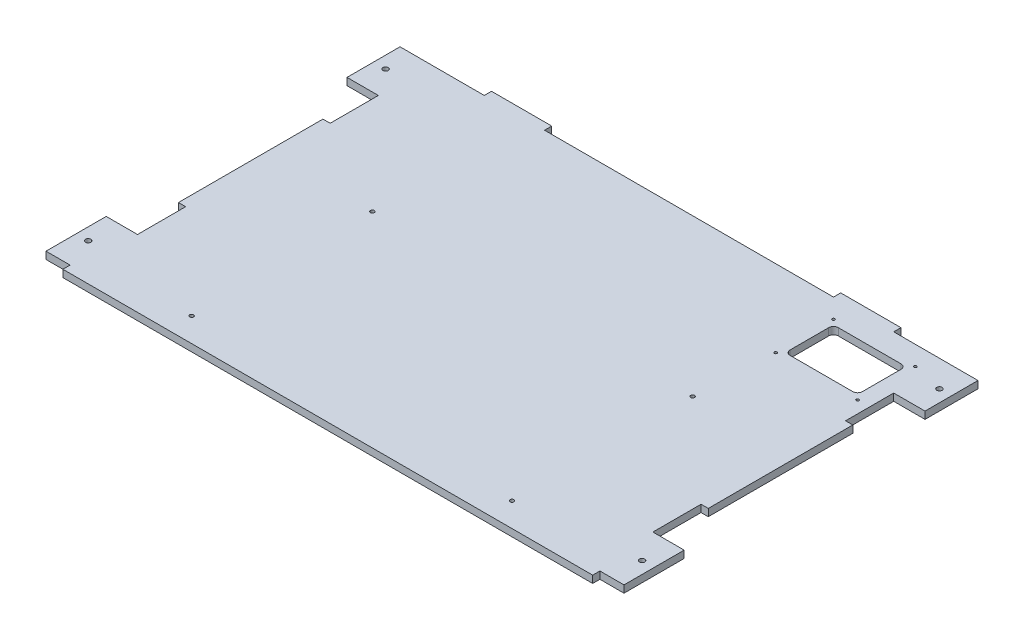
ISO-10303-21;
HEADER;
FILE_DESCRIPTION(('STEP AP214'),'2;1');
FILE_NAME('part.step','',(''),(''),'','','');
FILE_SCHEMA(('AUTOMOTIVE_DESIGN { 1 0 10303 214 1 1 1 1 }'));
ENDSEC;
DATA;
#1=APPLICATION_CONTEXT('core data for automotive mechanical design processes');
#2=APPLICATION_PROTOCOL_DEFINITION('international standard','automotive_design',2000,#1);
#3=PRODUCT_CONTEXT('',#1,'mechanical');
#4=PRODUCT('Part','Part','',(#3));
#5=PRODUCT_RELATED_PRODUCT_CATEGORY('part','',(#4));
#6=PRODUCT_DEFINITION_FORMATION('','',#4);
#7=PRODUCT_DEFINITION_CONTEXT('part definition',#1,'design');
#8=PRODUCT_DEFINITION('design','',#6,#7);
#9=PRODUCT_DEFINITION_SHAPE('','',#8);
#10=(LENGTH_UNIT() NAMED_UNIT(*) SI_UNIT(.MILLI.,.METRE.));
#11=(NAMED_UNIT(*) PLANE_ANGLE_UNIT() SI_UNIT($,.RADIAN.));
#12=(NAMED_UNIT(*) SI_UNIT($,.STERADIAN.) SOLID_ANGLE_UNIT());
#13=UNCERTAINTY_MEASURE_WITH_UNIT(LENGTH_MEASURE(1.E-05),#10,'distance_accuracy_value','');
#14=(GEOMETRIC_REPRESENTATION_CONTEXT(3) GLOBAL_UNCERTAINTY_ASSIGNED_CONTEXT((#13)) GLOBAL_UNIT_ASSIGNED_CONTEXT((#10,
#11,#12)) REPRESENTATION_CONTEXT('',''));
#15=CARTESIAN_POINT('',(0.,0.,0.));
#16=DIRECTION('',(0.,0.,1.));
#17=DIRECTION('',(1.,0.,0.));
#18=AXIS2_PLACEMENT_3D('',#15,#16,#17);
#19=CARTESIAN_POINT('',(0.,6.,0.));
#20=DIRECTION('',(0.,-1.,0.));
#21=DIRECTION('',(0.,0.,-1.));
#22=AXIS2_PLACEMENT_3D('',#19,#20,#21);
#23=PLANE('',#22);
#24=CARTESIAN_POINT('',(133.,6.,-20.));
#25=DIRECTION('',(0.,1.,0.));
#26=DIRECTION('',(0.,0.,-1.));
#27=AXIS2_PLACEMENT_3D('',#24,#25,#26);
#28=CIRCLE('',#27,1.59999999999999);
#29=CARTESIAN_POINT('',(133.,6.,-21.6));
#30=VERTEX_POINT('',#29);
#31=EDGE_CURVE('E1262',#30,#30,#28,.T.);
#32=ORIENTED_EDGE('',*,*,#31,.F.);
#33=EDGE_LOOP('',(#32));
#34=FACE_BOUND('',#33,.T.);
#35=CARTESIAN_POINT('',(-133.,6.,130.));
#36=DIRECTION('',(0.,1.,0.));
#37=DIRECTION('',(0.,0.,1.));
#38=AXIS2_PLACEMENT_3D('',#35,#36,#37);
#39=CIRCLE('',#38,1.59999999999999);
#40=CARTESIAN_POINT('',(-133.,6.,131.6));
#41=VERTEX_POINT('',#40);
#42=EDGE_CURVE('E1274',#41,#41,#39,.T.);
#43=ORIENTED_EDGE('',*,*,#42,.F.);
#44=EDGE_LOOP('',(#43));
#45=FACE_BOUND('',#44,.T.);
#46=CARTESIAN_POINT('',(136.,6.,-134.));
#47=DIRECTION('',(0.,1.,0.));
#48=DIRECTION('',(0.,0.,-1.));
#49=AXIS2_PLACEMENT_3D('',#46,#47,#48);
#50=CIRCLE('',#49,1.10000000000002);
#51=CARTESIAN_POINT('',(136.,6.,-135.1));
#52=VERTEX_POINT('',#51);
#53=EDGE_CURVE('E1286',#52,#52,#50,.T.);
#54=ORIENTED_EDGE('',*,*,#53,.F.);
#55=EDGE_LOOP('',(#54));
#56=FACE_BOUND('',#55,.T.);
#57=CARTESIAN_POINT('',(136.,6.,-86.));
#58=DIRECTION('',(0.,1.,0.));
#59=DIRECTION('',(0.,0.,1.));
#60=AXIS2_PLACEMENT_3D('',#57,#58,#59);
#61=CIRCLE('',#60,1.10000000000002);
#62=CARTESIAN_POINT('',(136.,6.,-84.9));
#63=VERTEX_POINT('',#62);
#64=EDGE_CURVE('E328',#63,#63,#61,.T.);
#65=ORIENTED_EDGE('',*,*,#64,.F.);
#66=EDGE_LOOP('',(#65));
#67=FACE_BOUND('',#66,.T.);
#68=CARTESIAN_POINT('',(230.,6.,-128.));
#69=DIRECTION('',(0.,1.,0.));
#70=DIRECTION('',(0.,0.,-1.));
#71=AXIS2_PLACEMENT_3D('',#68,#69,#70);
#72=CIRCLE('',#71,2.20000000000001);
#73=CARTESIAN_POINT('',(230.,6.,-130.2));
#74=VERTEX_POINT('',#73);
#75=EDGE_CURVE('E358',#74,#74,#72,.T.);
#76=ORIENTED_EDGE('',*,*,#75,.F.);
#77=EDGE_LOOP('',(#76));
#78=FACE_BOUND('',#77,.T.);
#79=CARTESIAN_POINT('',(-230.,6.,-128.));
#80=DIRECTION('',(0.,1.,0.));
#81=DIRECTION('',(0.,0.,1.));
#82=AXIS2_PLACEMENT_3D('',#79,#80,#81);
#83=CIRCLE('',#82,2.20000000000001);
#84=CARTESIAN_POINT('',(-230.,6.,-125.8));
#85=VERTEX_POINT('',#84);
#86=EDGE_CURVE('E370',#85,#85,#83,.T.);
#87=ORIENTED_EDGE('',*,*,#86,.F.);
#88=EDGE_LOOP('',(#87));
#89=FACE_BOUND('',#88,.T.);
#90=DIRECTION('',(-1.,0.,0.));
#91=VECTOR('',#90,1.);
#92=CARTESIAN_POINT('',(170.,6.,-156.));
#93=LINE('',#92,#91);
#94=CARTESIAN_POINT('',(170.,6.,-156.));
#95=VERTEX_POINT('',#94);
#96=CARTESIAN_POINT('',(120.,6.,-156.));
#97=VERTEX_POINT('',#96);
#98=EDGE_CURVE('E382',#95,#97,#93,.T.);
#99=ORIENTED_EDGE('',*,*,#98,.T.);
#100=DIRECTION('',(0.,0.,1.));
#101=VECTOR('',#100,1.);
#102=CARTESIAN_POINT('',(120.,6.,-150.));
#103=LINE('',#102,#101);
#104=CARTESIAN_POINT('',(120.,6.,-150.));
#105=VERTEX_POINT('',#104);
#106=EDGE_CURVE('E385',#97,#105,#103,.T.);
#107=ORIENTED_EDGE('',*,*,#106,.T.);
#108=DIRECTION('',(-1.,0.,0.));
#109=VECTOR('',#108,1.);
#110=CARTESIAN_POINT('',(-120.,6.,-150.));
#111=LINE('',#110,#109);
#112=CARTESIAN_POINT('',(-120.,6.,-150.));
#113=VERTEX_POINT('',#112);
#114=EDGE_CURVE('E388',#105,#113,#111,.T.);
#115=ORIENTED_EDGE('',*,*,#114,.T.);
#116=DIRECTION('',(0.,0.,-1.));
#117=VECTOR('',#116,1.);
#118=CARTESIAN_POINT('',(-120.,6.,-150.));
#119=LINE('',#118,#117);
#120=CARTESIAN_POINT('',(-120.,6.,-156.));
#121=VERTEX_POINT('',#120);
#122=EDGE_CURVE('E390',#113,#121,#119,.T.);
#123=ORIENTED_EDGE('',*,*,#122,.T.);
#124=DIRECTION('',(-1.,0.,0.));
#125=VECTOR('',#124,1.);
#126=CARTESIAN_POINT('',(-170.,6.,-156.));
#127=LINE('',#126,#125);
#128=CARTESIAN_POINT('',(-170.,6.,-156.));
#129=VERTEX_POINT('',#128);
#130=EDGE_CURVE('E392',#121,#129,#127,.T.);
#131=ORIENTED_EDGE('',*,*,#130,.T.);
#132=DIRECTION('',(0.,0.,1.));
#133=VECTOR('',#132,1.);
#134=CARTESIAN_POINT('',(-170.,6.,-150.));
#135=LINE('',#134,#133);
#136=CARTESIAN_POINT('',(-170.,6.,-150.));
#137=VERTEX_POINT('',#136);
#138=EDGE_CURVE('E394',#129,#137,#135,.T.);
#139=ORIENTED_EDGE('',*,*,#138,.T.);
#140=DIRECTION('',(-1.,0.,0.));
#141=VECTOR('',#140,1.);
#142=CARTESIAN_POINT('',(-220.,6.,-150.));
#143=LINE('',#142,#141);
#144=CARTESIAN_POINT('',(-240.,6.,-150.));
#145=VERTEX_POINT('',#144);
#146=EDGE_CURVE('E396',#137,#145,#143,.T.);
#147=ORIENTED_EDGE('',*,*,#146,.T.);
#148=DIRECTION('',(0.,0.,1.));
#149=VECTOR('',#148,1.);
#150=CARTESIAN_POINT('',(-240.,6.,-150.));
#151=LINE('',#150,#149);
#152=CARTESIAN_POINT('',(-240.,6.,-106.));
#153=VERTEX_POINT('',#152);
#154=EDGE_CURVE('E398',#145,#153,#151,.T.);
#155=ORIENTED_EDGE('',*,*,#154,.T.);
#156=DIRECTION('',(1.,0.,0.));
#157=VECTOR('',#156,1.);
#158=CARTESIAN_POINT('',(-240.,6.,-106.));
#159=LINE('',#158,#157);
#160=CARTESIAN_POINT('',(-214.,6.,-106.));
#161=VERTEX_POINT('',#160);
#162=EDGE_CURVE('E400',#153,#161,#159,.T.);
#163=ORIENTED_EDGE('',*,*,#162,.T.);
#164=DIRECTION('',(0.,0.,1.));
#165=VECTOR('',#164,1.);
#166=CARTESIAN_POINT('',(-214.,6.,-106.));
#167=LINE('',#166,#165);
#168=CARTESIAN_POINT('',(-214.,6.,-66.));
#169=VERTEX_POINT('',#168);
#170=EDGE_CURVE('E402',#161,#169,#167,.T.);
#171=ORIENTED_EDGE('',*,*,#170,.T.);
#172=DIRECTION('',(-1.,0.,0.));
#173=VECTOR('',#172,1.);
#174=CARTESIAN_POINT('',(-220.,6.,-66.));
#175=LINE('',#174,#173);
#176=CARTESIAN_POINT('',(-220.,6.,-66.));
#177=VERTEX_POINT('',#176);
#178=EDGE_CURVE('E404',#169,#177,#175,.T.);
#179=ORIENTED_EDGE('',*,*,#178,.T.);
#180=DIRECTION('',(0.,0.,1.));
#181=VECTOR('',#180,1.);
#182=CARTESIAN_POINT('',(-220.,6.,-66.));
#183=LINE('',#182,#181);
#184=CARTESIAN_POINT('',(-220.,6.,53.9999999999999));
#185=VERTEX_POINT('',#184);
#186=EDGE_CURVE('E406',#177,#185,#183,.T.);
#187=ORIENTED_EDGE('',*,*,#186,.T.);
#188=DIRECTION('',(1.,0.,0.));
#189=VECTOR('',#188,1.);
#190=CARTESIAN_POINT('',(-220.,6.,53.9999999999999));
#191=LINE('',#190,#189);
#192=CARTESIAN_POINT('',(-214.,6.,53.9999999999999));
#193=VERTEX_POINT('',#192);
#194=EDGE_CURVE('E408',#185,#193,#191,.T.);
#195=ORIENTED_EDGE('',*,*,#194,.T.);
#196=DIRECTION('',(0.,0.,1.));
#197=VECTOR('',#196,1.);
#198=CARTESIAN_POINT('',(-214.,6.,93.9999999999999));
#199=LINE('',#198,#197);
#200=CARTESIAN_POINT('',(-214.,6.,93.9999999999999));
#201=VERTEX_POINT('',#200);
#202=EDGE_CURVE('E410',#193,#201,#199,.T.);
#203=ORIENTED_EDGE('',*,*,#202,.T.);
#204=DIRECTION('',(-1.,0.,0.));
#205=VECTOR('',#204,1.);
#206=CARTESIAN_POINT('',(-220.,6.,93.9999999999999));
#207=LINE('',#206,#205);
#208=CARTESIAN_POINT('',(-240.,6.,93.9999999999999));
#209=VERTEX_POINT('',#208);
#210=EDGE_CURVE('E412',#201,#209,#207,.T.);
#211=ORIENTED_EDGE('',*,*,#210,.T.);
#212=DIRECTION('',(0.,0.,1.));
#213=VECTOR('',#212,1.);
#214=CARTESIAN_POINT('',(-240.,6.,144.));
#215=LINE('',#214,#213);
#216=CARTESIAN_POINT('',(-240.,6.,144.));
#217=VERTEX_POINT('',#216);
#218=EDGE_CURVE('E414',#209,#217,#215,.T.);
#219=ORIENTED_EDGE('',*,*,#218,.T.);
#220=DIRECTION('',(1.,0.,0.));
#221=VECTOR('',#220,1.);
#222=CARTESIAN_POINT('',(-220.,6.,144.));
#223=LINE('',#222,#221);
#224=CARTESIAN_POINT('',(-220.,6.,144.));
#225=VERTEX_POINT('',#224);
#226=EDGE_CURVE('E416',#217,#225,#223,.T.);
#227=ORIENTED_EDGE('',*,*,#226,.T.);
#228=DIRECTION('',(0.,0.,1.));
#229=VECTOR('',#228,1.);
#230=CARTESIAN_POINT('',(-220.,6.,144.));
#231=LINE('',#230,#229);
#232=CARTESIAN_POINT('',(-220.,6.,150.));
#233=VERTEX_POINT('',#232);
#234=EDGE_CURVE('E418',#225,#233,#231,.T.);
#235=ORIENTED_EDGE('',*,*,#234,.T.);
#236=DIRECTION('',(1.,0.,0.));
#237=VECTOR('',#236,1.);
#238=CARTESIAN_POINT('',(-220.,6.,150.));
#239=LINE('',#238,#237);
#240=CARTESIAN_POINT('',(220.,6.,150.));
#241=VERTEX_POINT('',#240);
#242=EDGE_CURVE('E420',#233,#241,#239,.T.);
#243=ORIENTED_EDGE('',*,*,#242,.T.);
#244=DIRECTION('',(0.,0.,-1.));
#245=VECTOR('',#244,1.);
#246=CARTESIAN_POINT('',(220.,6.,150.));
#247=LINE('',#246,#245);
#248=CARTESIAN_POINT('',(220.,6.,144.));
#249=VERTEX_POINT('',#248);
#250=EDGE_CURVE('E422',#241,#249,#247,.T.);
#251=ORIENTED_EDGE('',*,*,#250,.T.);
#252=DIRECTION('',(1.,0.,0.));
#253=VECTOR('',#252,1.);
#254=CARTESIAN_POINT('',(220.,6.,144.));
#255=LINE('',#254,#253);
#256=CARTESIAN_POINT('',(240.,6.,144.));
#257=VERTEX_POINT('',#256);
#258=EDGE_CURVE('E424',#249,#257,#255,.T.);
#259=ORIENTED_EDGE('',*,*,#258,.T.);
#260=DIRECTION('',(0.,0.,-1.));
#261=VECTOR('',#260,1.);
#262=CARTESIAN_POINT('',(240.,6.,144.));
#263=LINE('',#262,#261);
#264=CARTESIAN_POINT('',(240.,6.,93.9999999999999));
#265=VERTEX_POINT('',#264);
#266=EDGE_CURVE('E426',#257,#265,#263,.T.);
#267=ORIENTED_EDGE('',*,*,#266,.T.);
#268=DIRECTION('',(-1.,0.,0.));
#269=VECTOR('',#268,1.);
#270=CARTESIAN_POINT('',(220.,6.,93.9999999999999));
#271=LINE('',#270,#269);
#272=CARTESIAN_POINT('',(214.,6.,93.9999999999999));
#273=VERTEX_POINT('',#272);
#274=EDGE_CURVE('E428',#265,#273,#271,.T.);
#275=ORIENTED_EDGE('',*,*,#274,.T.);
#276=DIRECTION('',(0.,0.,-1.));
#277=VECTOR('',#276,1.);
#278=CARTESIAN_POINT('',(214.,6.,93.9999999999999));
#279=LINE('',#278,#277);
#280=CARTESIAN_POINT('',(214.,6.,53.9999999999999));
#281=VERTEX_POINT('',#280);
#282=EDGE_CURVE('E430',#273,#281,#279,.T.);
#283=ORIENTED_EDGE('',*,*,#282,.T.);
#284=DIRECTION('',(1.,0.,0.));
#285=VECTOR('',#284,1.);
#286=CARTESIAN_POINT('',(220.,6.,53.9999999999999));
#287=LINE('',#286,#285);
#288=CARTESIAN_POINT('',(220.,6.,53.9999999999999));
#289=VERTEX_POINT('',#288);
#290=EDGE_CURVE('E432',#281,#289,#287,.T.);
#291=ORIENTED_EDGE('',*,*,#290,.T.);
#292=DIRECTION('',(0.,0.,-1.));
#293=VECTOR('',#292,1.);
#294=CARTESIAN_POINT('',(220.,6.,53.9999999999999));
#295=LINE('',#294,#293);
#296=CARTESIAN_POINT('',(220.,6.,-66.));
#297=VERTEX_POINT('',#296);
#298=EDGE_CURVE('E434',#289,#297,#295,.T.);
#299=ORIENTED_EDGE('',*,*,#298,.T.);
#300=DIRECTION('',(-1.,0.,0.));
#301=VECTOR('',#300,1.);
#302=CARTESIAN_POINT('',(220.,6.,-66.));
#303=LINE('',#302,#301);
#304=CARTESIAN_POINT('',(214.,6.,-66.));
#305=VERTEX_POINT('',#304);
#306=EDGE_CURVE('E436',#297,#305,#303,.T.);
#307=ORIENTED_EDGE('',*,*,#306,.T.);
#308=DIRECTION('',(0.,0.,-1.));
#309=VECTOR('',#308,1.);
#310=CARTESIAN_POINT('',(214.,6.,-106.));
#311=LINE('',#310,#309);
#312=CARTESIAN_POINT('',(214.,6.,-106.));
#313=VERTEX_POINT('',#312);
#314=EDGE_CURVE('E438',#305,#313,#311,.T.);
#315=ORIENTED_EDGE('',*,*,#314,.T.);
#316=DIRECTION('',(1.,0.,0.));
#317=VECTOR('',#316,1.);
#318=CARTESIAN_POINT('',(220.,6.,-106.));
#319=LINE('',#318,#317);
#320=CARTESIAN_POINT('',(240.,6.,-106.));
#321=VERTEX_POINT('',#320);
#322=EDGE_CURVE('E440',#313,#321,#319,.T.);
#323=ORIENTED_EDGE('',*,*,#322,.T.);
#324=DIRECTION('',(0.,0.,-1.));
#325=VECTOR('',#324,1.);
#326=CARTESIAN_POINT('',(240.,6.,-150.));
#327=LINE('',#326,#325);
#328=CARTESIAN_POINT('',(240.,6.,-150.));
#329=VERTEX_POINT('',#328);
#330=EDGE_CURVE('E442',#321,#329,#327,.T.);
#331=ORIENTED_EDGE('',*,*,#330,.T.);
#332=DIRECTION('',(-1.,0.,0.));
#333=VECTOR('',#332,1.);
#334=CARTESIAN_POINT('',(220.,6.,-150.));
#335=LINE('',#334,#333);
#336=CARTESIAN_POINT('',(170.,6.,-150.));
#337=VERTEX_POINT('',#336);
#338=EDGE_CURVE('E444',#329,#337,#335,.T.);
#339=ORIENTED_EDGE('',*,*,#338,.T.);
#340=DIRECTION('',(0.,0.,-1.));
#341=VECTOR('',#340,1.);
#342=CARTESIAN_POINT('',(170.,6.,-150.));
#343=LINE('',#342,#341);
#344=EDGE_CURVE('E446',#337,#95,#343,.T.);
#345=ORIENTED_EDGE('',*,*,#344,.T.);
#346=EDGE_LOOP('',(#99,#107,#115,#123,#131,#139,#147,#155,#163,#171,#179,#187,#195,#203,#211,
#219,#227,#235,#243,#251,#259,#267,#275,#283,#291,#299,#307,#315,#323,#331,#339,#345));
#347=FACE_BOUND('',#346,.T.);
#348=CARTESIAN_POINT('',(-230.,6.,119.));
#349=DIRECTION('',(0.,1.,0.));
#350=DIRECTION('',(0.,0.,1.));
#351=AXIS2_PLACEMENT_3D('',#348,#349,#350);
#352=CIRCLE('',#351,2.20000000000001);
#353=CARTESIAN_POINT('',(-230.,6.,121.2));
#354=VERTEX_POINT('',#353);
#355=EDGE_CURVE('E376',#354,#354,#352,.T.);
#356=ORIENTED_EDGE('',*,*,#355,.F.);
#357=EDGE_LOOP('',(#356));
#358=FACE_BOUND('',#357,.T.);
#359=CARTESIAN_POINT('',(230.,6.,119.));
#360=DIRECTION('',(0.,1.,0.));
#361=DIRECTION('',(0.,0.,-1.));
#362=AXIS2_PLACEMENT_3D('',#359,#360,#361);
#363=CIRCLE('',#362,2.20000000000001);
#364=CARTESIAN_POINT('',(230.,6.,116.8));
#365=VERTEX_POINT('',#364);
#366=EDGE_CURVE('E364',#365,#365,#363,.T.);
#367=ORIENTED_EDGE('',*,*,#366,.F.);
#368=EDGE_LOOP('',(#367));
#369=FACE_BOUND('',#368,.T.);
#370=CARTESIAN_POINT('',(144.,6.,-126.));
#371=DIRECTION('',(0.,1.,0.));
#372=DIRECTION('',(0.,0.,-1.));
#373=AXIS2_PLACEMENT_3D('',#370,#371,#372);
#374=CIRCLE('',#373,4.00000000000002);
#375=CARTESIAN_POINT('',(144.,6.,-130.));
#376=VERTEX_POINT('',#375);
#377=CARTESIAN_POINT('',(140.,6.,-126.));
#378=VERTEX_POINT('',#377);
#379=EDGE_CURVE('E290',#376,#378,#374,.T.);
#380=ORIENTED_EDGE('',*,*,#379,.F.);
#381=DIRECTION('',(-1.,0.,0.));
#382=VECTOR('',#381,1.);
#383=CARTESIAN_POINT('',(144.,6.,-130.));
#384=LINE('',#383,#382);
#385=CARTESIAN_POINT('',(196.,6.,-130.));
#386=VERTEX_POINT('',#385);
#387=EDGE_CURVE('E325',#386,#376,#384,.T.);
#388=ORIENTED_EDGE('',*,*,#387,.F.);
#389=CARTESIAN_POINT('',(196.,6.,-126.));
#390=DIRECTION('',(0.,1.,0.));
#391=DIRECTION('',(0.,0.,-1.));
#392=AXIS2_PLACEMENT_3D('',#389,#390,#391);
#393=CIRCLE('',#392,4.00000000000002);
#394=CARTESIAN_POINT('',(200.,6.,-126.));
#395=VERTEX_POINT('',#394);
#396=EDGE_CURVE('E323',#395,#386,#393,.T.);
#397=ORIENTED_EDGE('',*,*,#396,.F.);
#398=DIRECTION('',(0.,0.,-1.));
#399=VECTOR('',#398,1.);
#400=CARTESIAN_POINT('',(200.,6.,-94.0000000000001));
#401=LINE('',#400,#399);
#402=CARTESIAN_POINT('',(200.,6.,-94.0000000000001));
#403=VERTEX_POINT('',#402);
#404=EDGE_CURVE('E321',#403,#395,#401,.T.);
#405=ORIENTED_EDGE('',*,*,#404,.F.);
#406=CARTESIAN_POINT('',(196.,6.,-94.0000000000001));
#407=DIRECTION('',(0.,1.,0.));
#408=DIRECTION('',(0.,0.,1.));
#409=AXIS2_PLACEMENT_3D('',#406,#407,#408);
#410=CIRCLE('',#409,4.00000000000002);
#411=CARTESIAN_POINT('',(196.,6.,-90.));
#412=VERTEX_POINT('',#411);
#413=EDGE_CURVE('E319',#412,#403,#410,.T.);
#414=ORIENTED_EDGE('',*,*,#413,.F.);
#415=DIRECTION('',(1.,0.,0.));
#416=VECTOR('',#415,1.);
#417=CARTESIAN_POINT('',(144.,6.,-90.));
#418=LINE('',#417,#416);
#419=CARTESIAN_POINT('',(144.,6.,-90.));
#420=VERTEX_POINT('',#419);
#421=EDGE_CURVE('E314',#420,#412,#418,.T.);
#422=ORIENTED_EDGE('',*,*,#421,.F.);
#423=CARTESIAN_POINT('',(144.,6.,-94.0000000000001));
#424=DIRECTION('',(0.,1.,0.));
#425=DIRECTION('',(0.,0.,-1.));
#426=AXIS2_PLACEMENT_3D('',#423,#424,#425);
#427=CIRCLE('',#426,4.00000000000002);
#428=CARTESIAN_POINT('',(140.,6.,-94.0000000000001));
#429=VERTEX_POINT('',#428);
#430=EDGE_CURVE('E312',#429,#420,#427,.T.);
#431=ORIENTED_EDGE('',*,*,#430,.F.);
#432=DIRECTION('',(0.,0.,1.));
#433=VECTOR('',#432,1.);
#434=CARTESIAN_POINT('',(140.,6.,-94.0000000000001));
#435=LINE('',#434,#433);
#436=EDGE_CURVE('E298',#378,#429,#435,.T.);
#437=ORIENTED_EDGE('',*,*,#436,.F.);
#438=EDGE_LOOP('',(#380,#388,#397,#405,#414,#422,#431,#437));
#439=FACE_BOUND('',#438,.T.);
#440=CARTESIAN_POINT('',(204.,6.,-86.));
#441=DIRECTION('',(0.,1.,0.));
#442=DIRECTION('',(0.,0.,-1.));
#443=AXIS2_PLACEMENT_3D('',#440,#441,#442);
#444=CIRCLE('',#443,1.10000000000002);
#445=CARTESIAN_POINT('',(204.,6.,-87.1000000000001));
#446=VERTEX_POINT('',#445);
#447=EDGE_CURVE('E1292',#446,#446,#444,.T.);
#448=ORIENTED_EDGE('',*,*,#447,.F.);
#449=EDGE_LOOP('',(#448));
#450=FACE_BOUND('',#449,.T.);
#451=CARTESIAN_POINT('',(204.,6.,-134.));
#452=DIRECTION('',(0.,1.,0.));
#453=DIRECTION('',(0.,0.,1.));
#454=AXIS2_PLACEMENT_3D('',#451,#452,#453);
#455=CIRCLE('',#454,1.10000000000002);
#456=CARTESIAN_POINT('',(204.,6.,-132.9));
#457=VERTEX_POINT('',#456);
#458=EDGE_CURVE('E1280',#457,#457,#455,.T.);
#459=ORIENTED_EDGE('',*,*,#458,.F.);
#460=EDGE_LOOP('',(#459));
#461=FACE_BOUND('',#460,.T.);
#462=CARTESIAN_POINT('',(-133.,6.,-20.));
#463=DIRECTION('',(0.,1.,0.));
#464=DIRECTION('',(0.,0.,1.));
#465=AXIS2_PLACEMENT_3D('',#462,#463,#464);
#466=CIRCLE('',#465,1.59999999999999);
#467=CARTESIAN_POINT('',(-133.,6.,-18.4));
#468=VERTEX_POINT('',#467);
#469=EDGE_CURVE('E1268',#468,#468,#466,.T.);
#470=ORIENTED_EDGE('',*,*,#469,.F.);
#471=EDGE_LOOP('',(#470));
#472=FACE_BOUND('',#471,.T.);
#473=CARTESIAN_POINT('',(133.,6.,130.));
#474=DIRECTION('',(0.,1.,0.));
#475=DIRECTION('',(0.,0.,-1.));
#476=AXIS2_PLACEMENT_3D('',#473,#474,#475);
#477=CIRCLE('',#476,1.59999999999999);
#478=CARTESIAN_POINT('',(133.,6.,128.4));
#479=VERTEX_POINT('',#478);
#480=EDGE_CURVE('E1253',#479,#479,#477,.T.);
#481=ORIENTED_EDGE('',*,*,#480,.F.);
#482=EDGE_LOOP('',(#481));
#483=FACE_BOUND('',#482,.T.);
#484=ADVANCED_FACE('F33',(#34,#45,#56,#67,#78,#89,#347,#358,#369,#439,#450,#461,#472,#483),#23,.F.);
#485=CARTESIAN_POINT('',(0.,0.,0.));
#486=DIRECTION('',(0.,-1.,0.));
#487=DIRECTION('',(0.,0.,-1.));
#488=AXIS2_PLACEMENT_3D('',#485,#486,#487);
#489=PLANE('',#488);
#490=CARTESIAN_POINT('',(133.,0.,-20.));
#491=DIRECTION('',(0.,1.,0.));
#492=DIRECTION('',(0.,0.,-1.));
#493=AXIS2_PLACEMENT_3D('',#490,#491,#492);
#494=CIRCLE('',#493,1.59999999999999);
#495=CARTESIAN_POINT('',(133.,0.,-21.6));
#496=VERTEX_POINT('',#495);
#497=EDGE_CURVE('E1259',#496,#496,#494,.T.);
#498=ORIENTED_EDGE('',*,*,#497,.T.);
#499=EDGE_LOOP('',(#498));
#500=FACE_BOUND('',#499,.T.);
#501=CARTESIAN_POINT('',(-133.,0.,130.));
#502=DIRECTION('',(0.,1.,0.));
#503=DIRECTION('',(0.,0.,1.));
#504=AXIS2_PLACEMENT_3D('',#501,#502,#503);
#505=CIRCLE('',#504,1.59999999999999);
#506=CARTESIAN_POINT('',(-133.,0.,131.6));
#507=VERTEX_POINT('',#506);
#508=EDGE_CURVE('E1271',#507,#507,#505,.T.);
#509=ORIENTED_EDGE('',*,*,#508,.T.);
#510=EDGE_LOOP('',(#509));
#511=FACE_BOUND('',#510,.T.);
#512=CARTESIAN_POINT('',(136.,0.,-134.));
#513=DIRECTION('',(0.,1.,0.));
#514=DIRECTION('',(0.,0.,-1.));
#515=AXIS2_PLACEMENT_3D('',#512,#513,#514);
#516=CIRCLE('',#515,1.10000000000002);
#517=CARTESIAN_POINT('',(136.,0.,-135.1));
#518=VERTEX_POINT('',#517);
#519=EDGE_CURVE('E1283',#518,#518,#516,.T.);
#520=ORIENTED_EDGE('',*,*,#519,.T.);
#521=EDGE_LOOP('',(#520));
#522=FACE_BOUND('',#521,.T.);
#523=CARTESIAN_POINT('',(136.,0.,-86.));
#524=DIRECTION('',(0.,1.,0.));
#525=DIRECTION('',(0.,0.,1.));
#526=AXIS2_PLACEMENT_3D('',#523,#524,#525);
#527=CIRCLE('',#526,1.10000000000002);
#528=CARTESIAN_POINT('',(136.,0.,-84.9));
#529=VERTEX_POINT('',#528);
#530=EDGE_CURVE('E1295',#529,#529,#527,.T.);
#531=ORIENTED_EDGE('',*,*,#530,.T.);
#532=EDGE_LOOP('',(#531));
#533=FACE_BOUND('',#532,.T.);
#534=CARTESIAN_POINT('',(230.,0.,-128.));
#535=DIRECTION('',(0.,1.,0.));
#536=DIRECTION('',(0.,0.,-1.));
#537=AXIS2_PLACEMENT_3D('',#534,#535,#536);
#538=CIRCLE('',#537,2.20000000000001);
#539=CARTESIAN_POINT('',(230.,0.,-130.2));
#540=VERTEX_POINT('',#539);
#541=EDGE_CURVE('E306',#540,#540,#538,.T.);
#542=ORIENTED_EDGE('',*,*,#541,.T.);
#543=EDGE_LOOP('',(#542));
#544=FACE_BOUND('',#543,.T.);
#545=CARTESIAN_POINT('',(-230.,0.,-128.));
#546=DIRECTION('',(0.,1.,0.));
#547=DIRECTION('',(0.,0.,1.));
#548=AXIS2_PLACEMENT_3D('',#545,#546,#547);
#549=CIRCLE('',#548,2.20000000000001);
#550=CARTESIAN_POINT('',(-230.,0.,-125.8));
#551=VERTEX_POINT('',#550);
#552=EDGE_CURVE('E367',#551,#551,#549,.T.);
#553=ORIENTED_EDGE('',*,*,#552,.T.);
#554=EDGE_LOOP('',(#553));
#555=FACE_BOUND('',#554,.T.);
#556=DIRECTION('',(-1.,0.,0.));
#557=VECTOR('',#556,1.);
#558=CARTESIAN_POINT('',(170.,0.,-156.));
#559=LINE('',#558,#557);
#560=CARTESIAN_POINT('',(170.,0.,-156.));
#561=VERTEX_POINT('',#560);
#562=CARTESIAN_POINT('',(120.,0.,-156.));
#563=VERTEX_POINT('',#562);
#564=EDGE_CURVE('E379',#561,#563,#559,.T.);
#565=ORIENTED_EDGE('',*,*,#564,.F.);
#566=DIRECTION('',(0.,0.,-1.));
#567=VECTOR('',#566,1.);
#568=CARTESIAN_POINT('',(170.,0.,-150.));
#569=LINE('',#568,#567);
#570=CARTESIAN_POINT('',(170.,0.,-150.));
#571=VERTEX_POINT('',#570);
#572=EDGE_CURVE('E386',#571,#561,#569,.T.);
#573=ORIENTED_EDGE('',*,*,#572,.F.);
#574=DIRECTION('',(-1.,0.,0.));
#575=VECTOR('',#574,1.);
#576=CARTESIAN_POINT('',(170.,0.,-150.));
#577=LINE('',#576,#575);
#578=CARTESIAN_POINT('',(240.,0.,-150.));
#579=VERTEX_POINT('',#578);
#580=EDGE_CURVE('E515',#579,#571,#577,.T.);
#581=ORIENTED_EDGE('',*,*,#580,.F.);
#582=DIRECTION('',(0.,0.,-1.));
#583=VECTOR('',#582,1.);
#584=CARTESIAN_POINT('',(240.,0.,-150.));
#585=LINE('',#584,#583);
#586=CARTESIAN_POINT('',(240.,0.,-106.));
#587=VERTEX_POINT('',#586);
#588=EDGE_CURVE('E512',#587,#579,#585,.T.);
#589=ORIENTED_EDGE('',*,*,#588,.F.);
#590=DIRECTION('',(1.,0.,0.));
#591=VECTOR('',#590,1.);
#592=CARTESIAN_POINT('',(240.,0.,-106.));
#593=LINE('',#592,#591);
#594=CARTESIAN_POINT('',(214.,0.,-106.));
#595=VERTEX_POINT('',#594);
#596=EDGE_CURVE('E510',#595,#587,#593,.T.);
#597=ORIENTED_EDGE('',*,*,#596,.F.);
#598=DIRECTION('',(0.,0.,-1.));
#599=VECTOR('',#598,1.);
#600=CARTESIAN_POINT('',(214.,0.,-106.));
#601=LINE('',#600,#599);
#602=CARTESIAN_POINT('',(214.,0.,-66.));
#603=VERTEX_POINT('',#602);
#604=EDGE_CURVE('E507',#603,#595,#601,.T.);
#605=ORIENTED_EDGE('',*,*,#604,.F.);
#606=DIRECTION('',(-1.,0.,0.));
#607=VECTOR('',#606,1.);
#608=CARTESIAN_POINT('',(220.,0.,-66.));
#609=LINE('',#608,#607);
#610=CARTESIAN_POINT('',(220.,0.,-66.));
#611=VERTEX_POINT('',#610);
#612=EDGE_CURVE('E505',#611,#603,#609,.T.);
#613=ORIENTED_EDGE('',*,*,#612,.F.);
#614=DIRECTION('',(0.,0.,-1.));
#615=VECTOR('',#614,1.);
#616=CARTESIAN_POINT('',(220.,0.,53.9999999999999));
#617=LINE('',#616,#615);
#618=CARTESIAN_POINT('',(220.,0.,53.9999999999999));
#619=VERTEX_POINT('',#618);
#620=EDGE_CURVE('E503',#619,#611,#617,.T.);
#621=ORIENTED_EDGE('',*,*,#620,.F.);
#622=DIRECTION('',(1.,0.,0.));
#623=VECTOR('',#622,1.);
#624=CARTESIAN_POINT('',(220.,0.,53.9999999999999));
#625=LINE('',#624,#623);
#626=CARTESIAN_POINT('',(214.,0.,53.9999999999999));
#627=VERTEX_POINT('',#626);
#628=EDGE_CURVE('E501',#627,#619,#625,.T.);
#629=ORIENTED_EDGE('',*,*,#628,.F.);
#630=DIRECTION('',(0.,0.,-1.));
#631=VECTOR('',#630,1.);
#632=CARTESIAN_POINT('',(214.,0.,93.9999999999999));
#633=LINE('',#632,#631);
#634=CARTESIAN_POINT('',(214.,0.,93.9999999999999));
#635=VERTEX_POINT('',#634);
#636=EDGE_CURVE('E499',#635,#627,#633,.T.);
#637=ORIENTED_EDGE('',*,*,#636,.F.);
#638=DIRECTION('',(-1.,0.,0.));
#639=VECTOR('',#638,1.);
#640=CARTESIAN_POINT('',(220.,0.,93.9999999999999));
#641=LINE('',#640,#639);
#642=CARTESIAN_POINT('',(240.,0.,93.9999999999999));
#643=VERTEX_POINT('',#642);
#644=EDGE_CURVE('E497',#643,#635,#641,.T.);
#645=ORIENTED_EDGE('',*,*,#644,.F.);
#646=DIRECTION('',(0.,0.,-1.));
#647=VECTOR('',#646,1.);
#648=CARTESIAN_POINT('',(240.,0.,144.));
#649=LINE('',#648,#647);
#650=CARTESIAN_POINT('',(240.,0.,144.));
#651=VERTEX_POINT('',#650);
#652=EDGE_CURVE('E494',#651,#643,#649,.T.);
#653=ORIENTED_EDGE('',*,*,#652,.F.);
#654=DIRECTION('',(1.,0.,0.));
#655=VECTOR('',#654,1.);
#656=CARTESIAN_POINT('',(220.,0.,144.));
#657=LINE('',#656,#655);
#658=CARTESIAN_POINT('',(220.,0.,144.));
#659=VERTEX_POINT('',#658);
#660=EDGE_CURVE('E492',#659,#651,#657,.T.);
#661=ORIENTED_EDGE('',*,*,#660,.F.);
#662=DIRECTION('',(0.,0.,-1.));
#663=VECTOR('',#662,1.);
#664=CARTESIAN_POINT('',(220.,0.,150.));
#665=LINE('',#664,#663);
#666=CARTESIAN_POINT('',(220.,0.,150.));
#667=VERTEX_POINT('',#666);
#668=EDGE_CURVE('E490',#667,#659,#665,.T.);
#669=ORIENTED_EDGE('',*,*,#668,.F.);
#670=DIRECTION('',(1.,0.,0.));
#671=VECTOR('',#670,1.);
#672=CARTESIAN_POINT('',(-220.,0.,150.));
#673=LINE('',#672,#671);
#674=CARTESIAN_POINT('',(-220.,0.,150.));
#675=VERTEX_POINT('',#674);
#676=EDGE_CURVE('E488',#675,#667,#673,.T.);
#677=ORIENTED_EDGE('',*,*,#676,.F.);
#678=DIRECTION('',(0.,0.,1.));
#679=VECTOR('',#678,1.);
#680=CARTESIAN_POINT('',(-220.,0.,144.));
#681=LINE('',#680,#679);
#682=CARTESIAN_POINT('',(-220.,0.,144.));
#683=VERTEX_POINT('',#682);
#684=EDGE_CURVE('E486',#683,#675,#681,.T.);
#685=ORIENTED_EDGE('',*,*,#684,.F.);
#686=DIRECTION('',(1.,0.,0.));
#687=VECTOR('',#686,1.);
#688=CARTESIAN_POINT('',(-220.,0.,144.));
#689=LINE('',#688,#687);
#690=CARTESIAN_POINT('',(-240.,0.,144.));
#691=VERTEX_POINT('',#690);
#692=EDGE_CURVE('E484',#691,#683,#689,.T.);
#693=ORIENTED_EDGE('',*,*,#692,.F.);
#694=DIRECTION('',(0.,0.,1.));
#695=VECTOR('',#694,1.);
#696=CARTESIAN_POINT('',(-240.,0.,144.));
#697=LINE('',#696,#695);
#698=CARTESIAN_POINT('',(-240.,0.,93.9999999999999));
#699=VERTEX_POINT('',#698);
#700=EDGE_CURVE('E482',#699,#691,#697,.T.);
#701=ORIENTED_EDGE('',*,*,#700,.F.);
#702=DIRECTION('',(-1.,0.,0.));
#703=VECTOR('',#702,1.);
#704=CARTESIAN_POINT('',(-220.,0.,93.9999999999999));
#705=LINE('',#704,#703);
#706=CARTESIAN_POINT('',(-214.,0.,93.9999999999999));
#707=VERTEX_POINT('',#706);
#708=EDGE_CURVE('E480',#707,#699,#705,.T.);
#709=ORIENTED_EDGE('',*,*,#708,.F.);
#710=DIRECTION('',(0.,0.,1.));
#711=VECTOR('',#710,1.);
#712=CARTESIAN_POINT('',(-214.,0.,93.9999999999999));
#713=LINE('',#712,#711);
#714=CARTESIAN_POINT('',(-214.,0.,53.9999999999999));
#715=VERTEX_POINT('',#714);
#716=EDGE_CURVE('E477',#715,#707,#713,.T.);
#717=ORIENTED_EDGE('',*,*,#716,.F.);
#718=DIRECTION('',(1.,0.,0.));
#719=VECTOR('',#718,1.);
#720=CARTESIAN_POINT('',(-220.,0.,53.9999999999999));
#721=LINE('',#720,#719);
#722=CARTESIAN_POINT('',(-220.,0.,53.9999999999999));
#723=VERTEX_POINT('',#722);
#724=EDGE_CURVE('E475',#723,#715,#721,.T.);
#725=ORIENTED_EDGE('',*,*,#724,.F.);
#726=DIRECTION('',(0.,0.,1.));
#727=VECTOR('',#726,1.);
#728=CARTESIAN_POINT('',(-220.,0.,-66.));
#729=LINE('',#728,#727);
#730=CARTESIAN_POINT('',(-220.,0.,-66.));
#731=VERTEX_POINT('',#730);
#732=EDGE_CURVE('E473',#731,#723,#729,.T.);
#733=ORIENTED_EDGE('',*,*,#732,.F.);
#734=DIRECTION('',(-1.,0.,0.));
#735=VECTOR('',#734,1.);
#736=CARTESIAN_POINT('',(-220.,0.,-66.));
#737=LINE('',#736,#735);
#738=CARTESIAN_POINT('',(-214.,0.,-66.));
#739=VERTEX_POINT('',#738);
#740=EDGE_CURVE('E471',#739,#731,#737,.T.);
#741=ORIENTED_EDGE('',*,*,#740,.F.);
#742=DIRECTION('',(0.,0.,1.));
#743=VECTOR('',#742,1.);
#744=CARTESIAN_POINT('',(-214.,0.,-106.));
#745=LINE('',#744,#743);
#746=CARTESIAN_POINT('',(-214.,0.,-106.));
#747=VERTEX_POINT('',#746);
#748=EDGE_CURVE('E469',#747,#739,#745,.T.);
#749=ORIENTED_EDGE('',*,*,#748,.F.);
#750=DIRECTION('',(1.,0.,0.));
#751=VECTOR('',#750,1.);
#752=CARTESIAN_POINT('',(-220.,0.,-106.));
#753=LINE('',#752,#751);
#754=CARTESIAN_POINT('',(-240.,0.,-106.));
#755=VERTEX_POINT('',#754);
#756=EDGE_CURVE('E467',#755,#747,#753,.T.);
#757=ORIENTED_EDGE('',*,*,#756,.F.);
#758=DIRECTION('',(0.,0.,1.));
#759=VECTOR('',#758,1.);
#760=CARTESIAN_POINT('',(-240.,0.,-150.));
#761=LINE('',#760,#759);
#762=CARTESIAN_POINT('',(-240.,0.,-150.));
#763=VERTEX_POINT('',#762);
#764=EDGE_CURVE('E464',#763,#755,#761,.T.);
#765=ORIENTED_EDGE('',*,*,#764,.F.);
#766=DIRECTION('',(-1.,0.,0.));
#767=VECTOR('',#766,1.);
#768=CARTESIAN_POINT('',(-220.,0.,-150.));
#769=LINE('',#768,#767);
#770=CARTESIAN_POINT('',(-170.,0.,-150.));
#771=VERTEX_POINT('',#770);
#772=EDGE_CURVE('E462',#771,#763,#769,.T.);
#773=ORIENTED_EDGE('',*,*,#772,.F.);
#774=DIRECTION('',(0.,0.,1.));
#775=VECTOR('',#774,1.);
#776=CARTESIAN_POINT('',(-170.,0.,-150.));
#777=LINE('',#776,#775);
#778=CARTESIAN_POINT('',(-170.,0.,-156.));
#779=VERTEX_POINT('',#778);
#780=EDGE_CURVE('E459',#779,#771,#777,.T.);
#781=ORIENTED_EDGE('',*,*,#780,.F.);
#782=DIRECTION('',(-1.,0.,0.));
#783=VECTOR('',#782,1.);
#784=CARTESIAN_POINT('',(-170.,0.,-156.));
#785=LINE('',#784,#783);
#786=CARTESIAN_POINT('',(-120.,0.,-156.));
#787=VERTEX_POINT('',#786);
#788=EDGE_CURVE('E457',#787,#779,#785,.T.);
#789=ORIENTED_EDGE('',*,*,#788,.F.);
#790=DIRECTION('',(0.,0.,-1.));
#791=VECTOR('',#790,1.);
#792=CARTESIAN_POINT('',(-120.,0.,-150.));
#793=LINE('',#792,#791);
#794=CARTESIAN_POINT('',(-120.,0.,-150.));
#795=VERTEX_POINT('',#794);
#796=EDGE_CURVE('E455',#795,#787,#793,.T.);
#797=ORIENTED_EDGE('',*,*,#796,.F.);
#798=DIRECTION('',(-1.,0.,0.));
#799=VECTOR('',#798,1.);
#800=CARTESIAN_POINT('',(-120.,0.,-150.));
#801=LINE('',#800,#799);
#802=CARTESIAN_POINT('',(120.,0.,-150.));
#803=VERTEX_POINT('',#802);
#804=EDGE_CURVE('E453',#803,#795,#801,.T.);
#805=ORIENTED_EDGE('',*,*,#804,.F.);
#806=DIRECTION('',(0.,0.,1.));
#807=VECTOR('',#806,1.);
#808=CARTESIAN_POINT('',(120.,0.,-150.));
#809=LINE('',#808,#807);
#810=EDGE_CURVE('E451',#563,#803,#809,.T.);
#811=ORIENTED_EDGE('',*,*,#810,.F.);
#812=EDGE_LOOP('',(#565,#573,#581,#589,#597,#605,#613,#621,#629,#637,#645,#653,#661,#669,#677,
#685,#693,#701,#709,#717,#725,#733,#741,#749,#757,#765,#773,#781,#789,#797,#805,#811));
#813=FACE_BOUND('',#812,.T.);
#814=CARTESIAN_POINT('',(-230.,0.,119.));
#815=DIRECTION('',(0.,1.,0.));
#816=DIRECTION('',(0.,0.,1.));
#817=AXIS2_PLACEMENT_3D('',#814,#815,#816);
#818=CIRCLE('',#817,2.20000000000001);
#819=CARTESIAN_POINT('',(-230.,0.,121.2));
#820=VERTEX_POINT('',#819);
#821=EDGE_CURVE('E373',#820,#820,#818,.T.);
#822=ORIENTED_EDGE('',*,*,#821,.T.);
#823=EDGE_LOOP('',(#822));
#824=FACE_BOUND('',#823,.T.);
#825=CARTESIAN_POINT('',(230.,0.,119.));
#826=DIRECTION('',(0.,1.,0.));
#827=DIRECTION('',(0.,0.,-1.));
#828=AXIS2_PLACEMENT_3D('',#825,#826,#827);
#829=CIRCLE('',#828,2.20000000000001);
#830=CARTESIAN_POINT('',(230.,0.,116.8));
#831=VERTEX_POINT('',#830);
#832=EDGE_CURVE('E361',#831,#831,#829,.T.);
#833=ORIENTED_EDGE('',*,*,#832,.T.);
#834=EDGE_LOOP('',(#833));
#835=FACE_BOUND('',#834,.T.);
#836=DIRECTION('',(-1.,0.,0.));
#837=VECTOR('',#836,1.);
#838=CARTESIAN_POINT('',(144.,0.,-130.));
#839=LINE('',#838,#837);
#840=CARTESIAN_POINT('',(196.,0.,-130.));
#841=VERTEX_POINT('',#840);
#842=CARTESIAN_POINT('',(144.,0.,-130.));
#843=VERTEX_POINT('',#842);
#844=EDGE_CURVE('E299',#841,#843,#839,.T.);
#845=ORIENTED_EDGE('',*,*,#844,.T.);
#846=CARTESIAN_POINT('',(144.,0.,-126.));
#847=DIRECTION('',(0.,1.,0.));
#848=DIRECTION('',(0.,0.,-1.));
#849=AXIS2_PLACEMENT_3D('',#846,#847,#848);
#850=CIRCLE('',#849,4.00000000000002);
#851=CARTESIAN_POINT('',(140.,0.,-126.));
#852=VERTEX_POINT('',#851);
#853=EDGE_CURVE('E56',#843,#852,#850,.T.);
#854=ORIENTED_EDGE('',*,*,#853,.T.);
#855=DIRECTION('',(0.,0.,1.));
#856=VECTOR('',#855,1.);
#857=CARTESIAN_POINT('',(140.,0.,-94.0000000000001));
#858=LINE('',#857,#856);
#859=CARTESIAN_POINT('',(140.,0.,-94.0000000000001));
#860=VERTEX_POINT('',#859);
#861=EDGE_CURVE('E305',#852,#860,#858,.T.);
#862=ORIENTED_EDGE('',*,*,#861,.T.);
#863=CARTESIAN_POINT('',(144.,0.,-94.0000000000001));
#864=DIRECTION('',(0.,1.,0.));
#865=DIRECTION('',(0.,0.,-1.));
#866=AXIS2_PLACEMENT_3D('',#863,#864,#865);
#867=CIRCLE('',#866,4.00000000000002);
#868=CARTESIAN_POINT('',(144.,0.,-90.));
#869=VERTEX_POINT('',#868);
#870=EDGE_CURVE('E330',#860,#869,#867,.T.);
#871=ORIENTED_EDGE('',*,*,#870,.T.);
#872=DIRECTION('',(1.,0.,0.));
#873=VECTOR('',#872,1.);
#874=CARTESIAN_POINT('',(144.,0.,-90.));
#875=LINE('',#874,#873);
#876=CARTESIAN_POINT('',(196.,0.,-90.));
#877=VERTEX_POINT('',#876);
#878=EDGE_CURVE('E333',#869,#877,#875,.T.);
#879=ORIENTED_EDGE('',*,*,#878,.T.);
#880=CARTESIAN_POINT('',(196.,0.,-94.0000000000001));
#881=DIRECTION('',(0.,1.,0.));
#882=DIRECTION('',(0.,0.,1.));
#883=AXIS2_PLACEMENT_3D('',#880,#881,#882);
#884=CIRCLE('',#883,4.00000000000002);
#885=CARTESIAN_POINT('',(200.,0.,-94.0000000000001));
#886=VERTEX_POINT('',#885);
#887=EDGE_CURVE('E336',#877,#886,#884,.T.);
#888=ORIENTED_EDGE('',*,*,#887,.T.);
#889=DIRECTION('',(0.,0.,-1.));
#890=VECTOR('',#889,1.);
#891=CARTESIAN_POINT('',(200.,0.,-94.0000000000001));
#892=LINE('',#891,#890);
#893=CARTESIAN_POINT('',(200.,0.,-126.));
#894=VERTEX_POINT('',#893);
#895=EDGE_CURVE('E339',#886,#894,#892,.T.);
#896=ORIENTED_EDGE('',*,*,#895,.T.);
#897=CARTESIAN_POINT('',(196.,0.,-126.));
#898=DIRECTION('',(0.,1.,0.));
#899=DIRECTION('',(0.,0.,-1.));
#900=AXIS2_PLACEMENT_3D('',#897,#898,#899);
#901=CIRCLE('',#900,4.00000000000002);
#902=EDGE_CURVE('E342',#894,#841,#901,.T.);
#903=ORIENTED_EDGE('',*,*,#902,.T.);
#904=EDGE_LOOP('',(#845,#854,#862,#871,#879,#888,#896,#903));
#905=FACE_BOUND('',#904,.T.);
#906=CARTESIAN_POINT('',(204.,0.,-86.));
#907=DIRECTION('',(0.,1.,0.));
#908=DIRECTION('',(0.,0.,-1.));
#909=AXIS2_PLACEMENT_3D('',#906,#907,#908);
#910=CIRCLE('',#909,1.10000000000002);
#911=CARTESIAN_POINT('',(204.,0.,-87.1000000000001));
#912=VERTEX_POINT('',#911);
#913=EDGE_CURVE('E1289',#912,#912,#910,.T.);
#914=ORIENTED_EDGE('',*,*,#913,.T.);
#915=EDGE_LOOP('',(#914));
#916=FACE_BOUND('',#915,.T.);
#917=CARTESIAN_POINT('',(204.,0.,-134.));
#918=DIRECTION('',(0.,1.,0.));
#919=DIRECTION('',(0.,0.,1.));
#920=AXIS2_PLACEMENT_3D('',#917,#918,#919);
#921=CIRCLE('',#920,1.10000000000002);
#922=CARTESIAN_POINT('',(204.,0.,-132.9));
#923=VERTEX_POINT('',#922);
#924=EDGE_CURVE('E1277',#923,#923,#921,.T.);
#925=ORIENTED_EDGE('',*,*,#924,.T.);
#926=EDGE_LOOP('',(#925));
#927=FACE_BOUND('',#926,.T.);
#928=CARTESIAN_POINT('',(-133.,0.,-20.));
#929=DIRECTION('',(0.,1.,0.));
#930=DIRECTION('',(0.,0.,1.));
#931=AXIS2_PLACEMENT_3D('',#928,#929,#930);
#932=CIRCLE('',#931,1.59999999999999);
#933=CARTESIAN_POINT('',(-133.,0.,-18.4));
#934=VERTEX_POINT('',#933);
#935=EDGE_CURVE('E1265',#934,#934,#932,.T.);
#936=ORIENTED_EDGE('',*,*,#935,.T.);
#937=EDGE_LOOP('',(#936));
#938=FACE_BOUND('',#937,.T.);
#939=CARTESIAN_POINT('',(133.,0.,130.));
#940=DIRECTION('',(0.,1.,0.));
#941=DIRECTION('',(0.,0.,-1.));
#942=AXIS2_PLACEMENT_3D('',#939,#940,#941);
#943=CIRCLE('',#942,1.59999999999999);
#944=CARTESIAN_POINT('',(133.,0.,128.4));
#945=VERTEX_POINT('',#944);
#946=EDGE_CURVE('E1256',#945,#945,#943,.T.);
#947=ORIENTED_EDGE('',*,*,#946,.T.);
#948=EDGE_LOOP('',(#947));
#949=FACE_BOUND('',#948,.T.);
#950=ADVANCED_FACE('F617',(#500,#511,#522,#533,#544,#555,#813,#824,#835,#905,#916,#927,#938,
#949),#489,.T.);
#951=CARTESIAN_POINT('',(170.,6.,-156.));
#952=DIRECTION('',(0.,0.,1.));
#953=DIRECTION('',(1.,0.,0.));
#954=AXIS2_PLACEMENT_3D('',#951,#952,#953);
#955=PLANE('',#954);
#956=ORIENTED_EDGE('',*,*,#564,.T.);
#957=DIRECTION('',(0.,-1.,0.));
#958=VECTOR('',#957,1.);
#959=CARTESIAN_POINT('',(120.,6.,-156.));
#960=LINE('',#959,#958);
#961=EDGE_CURVE('E11',#97,#563,#960,.T.);
#962=ORIENTED_EDGE('',*,*,#961,.F.);
#963=ORIENTED_EDGE('',*,*,#98,.F.);
#964=DIRECTION('',(0.,-1.,0.));
#965=VECTOR('',#964,1.);
#966=CARTESIAN_POINT('',(170.,6.,-156.));
#967=LINE('',#966,#965);
#968=EDGE_CURVE('E448',#95,#561,#967,.T.);
#969=ORIENTED_EDGE('',*,*,#968,.T.);
#970=EDGE_LOOP('',(#956,#962,#963,#969));
#971=FACE_BOUND('',#970,.T.);
#972=ADVANCED_FACE('F35',(#971),#955,.F.);
#973=CARTESIAN_POINT('',(120.,6.,-150.));
#974=DIRECTION('',(1.,0.,0.));
#975=DIRECTION('',(0.,0.,-1.));
#976=AXIS2_PLACEMENT_3D('',#973,#974,#975);
#977=PLANE('',#976);
#978=ORIENTED_EDGE('',*,*,#810,.T.);
#979=DIRECTION('',(0.,-1.,0.));
#980=VECTOR('',#979,1.);
#981=CARTESIAN_POINT('',(120.,6.,-150.));
#982=LINE('',#981,#980);
#983=EDGE_CURVE('E41',#105,#803,#982,.T.);
#984=ORIENTED_EDGE('',*,*,#983,.F.);
#985=ORIENTED_EDGE('',*,*,#106,.F.);
#986=ORIENTED_EDGE('',*,*,#961,.T.);
#987=EDGE_LOOP('',(#978,#984,#985,#986));
#988=FACE_BOUND('',#987,.T.);
#989=ADVANCED_FACE('F635',(#988),#977,.F.);
#990=CARTESIAN_POINT('',(-120.,6.,-150.));
#991=DIRECTION('',(0.,0.,1.));
#992=DIRECTION('',(1.,0.,0.));
#993=AXIS2_PLACEMENT_3D('',#990,#991,#992);
#994=PLANE('',#993);
#995=ORIENTED_EDGE('',*,*,#804,.T.);
#996=DIRECTION('',(0.,-1.,0.));
#997=VECTOR('',#996,1.);
#998=CARTESIAN_POINT('',(-120.,6.,-150.));
#999=LINE('',#998,#997);
#1000=EDGE_CURVE('E604',#113,#795,#999,.T.);
#1001=ORIENTED_EDGE('',*,*,#1000,.F.);
#1002=ORIENTED_EDGE('',*,*,#114,.F.);
#1003=ORIENTED_EDGE('',*,*,#983,.T.);
#1004=EDGE_LOOP('',(#995,#1001,#1002,#1003));
#1005=FACE_BOUND('',#1004,.T.);
#1006=ADVANCED_FACE('F611',(#1005),#994,.F.);
#1007=CARTESIAN_POINT('',(-120.,6.,-150.));
#1008=DIRECTION('',(-1.,0.,0.));
#1009=DIRECTION('',(0.,0.,1.));
#1010=AXIS2_PLACEMENT_3D('',#1007,#1008,#1009);
#1011=PLANE('',#1010);
#1012=ORIENTED_EDGE('',*,*,#796,.T.);
#1013=DIRECTION('',(0.,-1.,0.));
#1014=VECTOR('',#1013,1.);
#1015=CARTESIAN_POINT('',(-120.,6.,-156.));
#1016=LINE('',#1015,#1014);
#1017=EDGE_CURVE('E601',#121,#787,#1016,.T.);
#1018=ORIENTED_EDGE('',*,*,#1017,.F.);
#1019=ORIENTED_EDGE('',*,*,#122,.F.);
#1020=ORIENTED_EDGE('',*,*,#1000,.T.);
#1021=EDGE_LOOP('',(#1012,#1018,#1019,#1020));
#1022=FACE_BOUND('',#1021,.T.);
#1023=ADVANCED_FACE('F623',(#1022),#1011,.F.);
#1024=CARTESIAN_POINT('',(-170.,6.,-156.));
#1025=DIRECTION('',(0.,0.,1.));
#1026=DIRECTION('',(1.,0.,0.));
#1027=AXIS2_PLACEMENT_3D('',#1024,#1025,#1026);
#1028=PLANE('',#1027);
#1029=ORIENTED_EDGE('',*,*,#788,.T.);
#1030=DIRECTION('',(0.,-1.,0.));
#1031=VECTOR('',#1030,1.);
#1032=CARTESIAN_POINT('',(-170.,6.,-156.));
#1033=LINE('',#1032,#1031);
#1034=EDGE_CURVE('E598',#129,#779,#1033,.T.);
#1035=ORIENTED_EDGE('',*,*,#1034,.F.);
#1036=ORIENTED_EDGE('',*,*,#130,.F.);
#1037=ORIENTED_EDGE('',*,*,#1017,.T.);
#1038=EDGE_LOOP('',(#1029,#1035,#1036,#1037));
#1039=FACE_BOUND('',#1038,.T.);
#1040=ADVANCED_FACE('F627',(#1039),#1028,.F.);
#1041=CARTESIAN_POINT('',(-170.,6.,-150.));
#1042=DIRECTION('',(1.,0.,0.));
#1043=DIRECTION('',(0.,0.,-1.));
#1044=AXIS2_PLACEMENT_3D('',#1041,#1042,#1043);
#1045=PLANE('',#1044);
#1046=ORIENTED_EDGE('',*,*,#780,.T.);
#1047=DIRECTION('',(0.,-1.,0.));
#1048=VECTOR('',#1047,1.);
#1049=CARTESIAN_POINT('',(-170.,6.,-150.));
#1050=LINE('',#1049,#1048);
#1051=EDGE_CURVE('E595',#137,#771,#1050,.T.);
#1052=ORIENTED_EDGE('',*,*,#1051,.F.);
#1053=ORIENTED_EDGE('',*,*,#138,.F.);
#1054=ORIENTED_EDGE('',*,*,#1034,.T.);
#1055=EDGE_LOOP('',(#1046,#1052,#1053,#1054));
#1056=FACE_BOUND('',#1055,.T.);
#1057=ADVANCED_FACE('F762',(#1056),#1045,.F.);
#1058=CARTESIAN_POINT('',(-220.,6.,-150.));
#1059=DIRECTION('',(0.,0.,1.));
#1060=DIRECTION('',(1.,0.,0.));
#1061=AXIS2_PLACEMENT_3D('',#1058,#1059,#1060);
#1062=PLANE('',#1061);
#1063=ORIENTED_EDGE('',*,*,#772,.T.);
#1064=DIRECTION('',(0.,-1.,0.));
#1065=VECTOR('',#1064,1.);
#1066=CARTESIAN_POINT('',(-240.,6.,-150.));
#1067=LINE('',#1066,#1065);
#1068=EDGE_CURVE('E592',#145,#763,#1067,.T.);
#1069=ORIENTED_EDGE('',*,*,#1068,.F.);
#1070=ORIENTED_EDGE('',*,*,#146,.F.);
#1071=ORIENTED_EDGE('',*,*,#1051,.T.);
#1072=EDGE_LOOP('',(#1063,#1069,#1070,#1071));
#1073=FACE_BOUND('',#1072,.T.);
#1074=ADVANCED_FACE('F760',(#1073),#1062,.F.);
#1075=CARTESIAN_POINT('',(-240.,6.,-150.));
#1076=DIRECTION('',(1.,0.,0.));
#1077=DIRECTION('',(0.,0.,-1.));
#1078=AXIS2_PLACEMENT_3D('',#1075,#1076,#1077);
#1079=PLANE('',#1078);
#1080=ORIENTED_EDGE('',*,*,#764,.T.);
#1081=DIRECTION('',(0.,-1.,0.));
#1082=VECTOR('',#1081,1.);
#1083=CARTESIAN_POINT('',(-240.,6.,-106.));
#1084=LINE('',#1083,#1082);
#1085=EDGE_CURVE('E589',#153,#755,#1084,.T.);
#1086=ORIENTED_EDGE('',*,*,#1085,.F.);
#1087=ORIENTED_EDGE('',*,*,#154,.F.);
#1088=ORIENTED_EDGE('',*,*,#1068,.T.);
#1089=EDGE_LOOP('',(#1080,#1086,#1087,#1088));
#1090=FACE_BOUND('',#1089,.T.);
#1091=ADVANCED_FACE('F753',(#1090),#1079,.F.);
#1092=CARTESIAN_POINT('',(-220.,6.,-106.));
#1093=DIRECTION('',(0.,0.,-1.));
#1094=DIRECTION('',(-1.,0.,0.));
#1095=AXIS2_PLACEMENT_3D('',#1092,#1093,#1094);
#1096=PLANE('',#1095);
#1097=ORIENTED_EDGE('',*,*,#756,.T.);
#1098=DIRECTION('',(0.,-1.,0.));
#1099=VECTOR('',#1098,1.);
#1100=CARTESIAN_POINT('',(-214.,6.,-106.));
#1101=LINE('',#1100,#1099);
#1102=EDGE_CURVE('E586',#161,#747,#1101,.T.);
#1103=ORIENTED_EDGE('',*,*,#1102,.F.);
#1104=ORIENTED_EDGE('',*,*,#162,.F.);
#1105=ORIENTED_EDGE('',*,*,#1085,.T.);
#1106=EDGE_LOOP('',(#1097,#1103,#1104,#1105));
#1107=FACE_BOUND('',#1106,.T.);
#1108=ADVANCED_FACE('F757',(#1107),#1096,.F.);
#1109=CARTESIAN_POINT('',(-214.,6.,-106.));
#1110=DIRECTION('',(1.,0.,0.));
#1111=DIRECTION('',(0.,0.,-1.));
#1112=AXIS2_PLACEMENT_3D('',#1109,#1110,#1111);
#1113=PLANE('',#1112);
#1114=ORIENTED_EDGE('',*,*,#748,.T.);
#1115=DIRECTION('',(0.,-1.,0.));
#1116=VECTOR('',#1115,1.);
#1117=CARTESIAN_POINT('',(-214.,6.,-66.));
#1118=LINE('',#1117,#1116);
#1119=EDGE_CURVE('E583',#169,#739,#1118,.T.);
#1120=ORIENTED_EDGE('',*,*,#1119,.F.);
#1121=ORIENTED_EDGE('',*,*,#170,.F.);
#1122=ORIENTED_EDGE('',*,*,#1102,.T.);
#1123=EDGE_LOOP('',(#1114,#1120,#1121,#1122));
#1124=FACE_BOUND('',#1123,.T.);
#1125=ADVANCED_FACE('F747',(#1124),#1113,.F.);
#1126=CARTESIAN_POINT('',(-220.,6.,-66.));
#1127=DIRECTION('',(0.,0.,1.));
#1128=DIRECTION('',(1.,0.,0.));
#1129=AXIS2_PLACEMENT_3D('',#1126,#1127,#1128);
#1130=PLANE('',#1129);
#1131=ORIENTED_EDGE('',*,*,#740,.T.);
#1132=DIRECTION('',(0.,-1.,0.));
#1133=VECTOR('',#1132,1.);
#1134=CARTESIAN_POINT('',(-220.,6.,-66.));
#1135=LINE('',#1134,#1133);
#1136=EDGE_CURVE('E580',#177,#731,#1135,.T.);
#1137=ORIENTED_EDGE('',*,*,#1136,.F.);
#1138=ORIENTED_EDGE('',*,*,#178,.F.);
#1139=ORIENTED_EDGE('',*,*,#1119,.T.);
#1140=EDGE_LOOP('',(#1131,#1137,#1138,#1139));
#1141=FACE_BOUND('',#1140,.T.);
#1142=ADVANCED_FACE('F743',(#1141),#1130,.F.);
#1143=CARTESIAN_POINT('',(-220.,6.,-66.));
#1144=DIRECTION('',(1.,0.,0.));
#1145=DIRECTION('',(0.,0.,-1.));
#1146=AXIS2_PLACEMENT_3D('',#1143,#1144,#1145);
#1147=PLANE('',#1146);
#1148=ORIENTED_EDGE('',*,*,#732,.T.);
#1149=DIRECTION('',(0.,-1.,0.));
#1150=VECTOR('',#1149,1.);
#1151=CARTESIAN_POINT('',(-220.,6.,53.9999999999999));
#1152=LINE('',#1151,#1150);
#1153=EDGE_CURVE('E577',#185,#723,#1152,.T.);
#1154=ORIENTED_EDGE('',*,*,#1153,.F.);
#1155=ORIENTED_EDGE('',*,*,#186,.F.);
#1156=ORIENTED_EDGE('',*,*,#1136,.T.);
#1157=EDGE_LOOP('',(#1148,#1154,#1155,#1156));
#1158=FACE_BOUND('',#1157,.T.);
#1159=ADVANCED_FACE('F738',(#1158),#1147,.F.);
#1160=CARTESIAN_POINT('',(-220.,6.,53.9999999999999));
#1161=DIRECTION('',(0.,0.,-1.));
#1162=DIRECTION('',(-1.,0.,0.));
#1163=AXIS2_PLACEMENT_3D('',#1160,#1161,#1162);
#1164=PLANE('',#1163);
#1165=ORIENTED_EDGE('',*,*,#724,.T.);
#1166=DIRECTION('',(0.,-1.,0.));
#1167=VECTOR('',#1166,1.);
#1168=CARTESIAN_POINT('',(-214.,6.,53.9999999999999));
#1169=LINE('',#1168,#1167);
#1170=EDGE_CURVE('E574',#193,#715,#1169,.T.);
#1171=ORIENTED_EDGE('',*,*,#1170,.F.);
#1172=ORIENTED_EDGE('',*,*,#194,.F.);
#1173=ORIENTED_EDGE('',*,*,#1153,.T.);
#1174=EDGE_LOOP('',(#1165,#1171,#1172,#1173));
#1175=FACE_BOUND('',#1174,.T.);
#1176=ADVANCED_FACE('F732',(#1175),#1164,.F.);
#1177=CARTESIAN_POINT('',(-214.,6.,93.9999999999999));
#1178=DIRECTION('',(1.,0.,0.));
#1179=DIRECTION('',(0.,0.,-1.));
#1180=AXIS2_PLACEMENT_3D('',#1177,#1178,#1179);
#1181=PLANE('',#1180);
#1182=ORIENTED_EDGE('',*,*,#716,.T.);
#1183=DIRECTION('',(0.,-1.,0.));
#1184=VECTOR('',#1183,1.);
#1185=CARTESIAN_POINT('',(-214.,6.,93.9999999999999));
#1186=LINE('',#1185,#1184);
#1187=EDGE_CURVE('E571',#201,#707,#1186,.T.);
#1188=ORIENTED_EDGE('',*,*,#1187,.F.);
#1189=ORIENTED_EDGE('',*,*,#202,.F.);
#1190=ORIENTED_EDGE('',*,*,#1170,.T.);
#1191=EDGE_LOOP('',(#1182,#1188,#1189,#1190));
#1192=FACE_BOUND('',#1191,.T.);
#1193=ADVANCED_FACE('F727',(#1192),#1181,.F.);
#1194=CARTESIAN_POINT('',(-220.,6.,93.9999999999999));
#1195=DIRECTION('',(0.,0.,1.));
#1196=DIRECTION('',(1.,0.,0.));
#1197=AXIS2_PLACEMENT_3D('',#1194,#1195,#1196);
#1198=PLANE('',#1197);
#1199=ORIENTED_EDGE('',*,*,#708,.T.);
#1200=DIRECTION('',(0.,-1.,0.));
#1201=VECTOR('',#1200,1.);
#1202=CARTESIAN_POINT('',(-240.,6.,93.9999999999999));
#1203=LINE('',#1202,#1201);
#1204=EDGE_CURVE('E568',#209,#699,#1203,.T.);
#1205=ORIENTED_EDGE('',*,*,#1204,.F.);
#1206=ORIENTED_EDGE('',*,*,#210,.F.);
#1207=ORIENTED_EDGE('',*,*,#1187,.T.);
#1208=EDGE_LOOP('',(#1199,#1205,#1206,#1207));
#1209=FACE_BOUND('',#1208,.T.);
#1210=ADVANCED_FACE('F722',(#1209),#1198,.F.);
#1211=CARTESIAN_POINT('',(-240.,6.,144.));
#1212=DIRECTION('',(1.,0.,0.));
#1213=DIRECTION('',(0.,0.,-1.));
#1214=AXIS2_PLACEMENT_3D('',#1211,#1212,#1213);
#1215=PLANE('',#1214);
#1216=ORIENTED_EDGE('',*,*,#700,.T.);
#1217=DIRECTION('',(0.,-1.,0.));
#1218=VECTOR('',#1217,1.);
#1219=CARTESIAN_POINT('',(-240.,6.,144.));
#1220=LINE('',#1219,#1218);
#1221=EDGE_CURVE('E565',#217,#691,#1220,.T.);
#1222=ORIENTED_EDGE('',*,*,#1221,.F.);
#1223=ORIENTED_EDGE('',*,*,#218,.F.);
#1224=ORIENTED_EDGE('',*,*,#1204,.T.);
#1225=EDGE_LOOP('',(#1216,#1222,#1223,#1224));
#1226=FACE_BOUND('',#1225,.T.);
#1227=ADVANCED_FACE('F718',(#1226),#1215,.F.);
#1228=CARTESIAN_POINT('',(-220.,6.,144.));
#1229=DIRECTION('',(0.,0.,-1.));
#1230=DIRECTION('',(-1.,0.,0.));
#1231=AXIS2_PLACEMENT_3D('',#1228,#1229,#1230);
#1232=PLANE('',#1231);
#1233=ORIENTED_EDGE('',*,*,#692,.T.);
#1234=DIRECTION('',(0.,-1.,0.));
#1235=VECTOR('',#1234,1.);
#1236=CARTESIAN_POINT('',(-220.,6.,144.));
#1237=LINE('',#1236,#1235);
#1238=EDGE_CURVE('E562',#225,#683,#1237,.T.);
#1239=ORIENTED_EDGE('',*,*,#1238,.F.);
#1240=ORIENTED_EDGE('',*,*,#226,.F.);
#1241=ORIENTED_EDGE('',*,*,#1221,.T.);
#1242=EDGE_LOOP('',(#1233,#1239,#1240,#1241));
#1243=FACE_BOUND('',#1242,.T.);
#1244=ADVANCED_FACE('F713',(#1243),#1232,.F.);
#1245=CARTESIAN_POINT('',(-220.,6.,144.));
#1246=DIRECTION('',(1.,0.,0.));
#1247=DIRECTION('',(0.,0.,-1.));
#1248=AXIS2_PLACEMENT_3D('',#1245,#1246,#1247);
#1249=PLANE('',#1248);
#1250=ORIENTED_EDGE('',*,*,#684,.T.);
#1251=DIRECTION('',(0.,-1.,0.));
#1252=VECTOR('',#1251,1.);
#1253=CARTESIAN_POINT('',(-220.,6.,150.));
#1254=LINE('',#1253,#1252);
#1255=EDGE_CURVE('E559',#233,#675,#1254,.T.);
#1256=ORIENTED_EDGE('',*,*,#1255,.F.);
#1257=ORIENTED_EDGE('',*,*,#234,.F.);
#1258=ORIENTED_EDGE('',*,*,#1238,.T.);
#1259=EDGE_LOOP('',(#1250,#1256,#1257,#1258));
#1260=FACE_BOUND('',#1259,.T.);
#1261=ADVANCED_FACE('F708',(#1260),#1249,.F.);
#1262=CARTESIAN_POINT('',(-220.,6.,150.));
#1263=DIRECTION('',(0.,0.,-1.));
#1264=DIRECTION('',(-1.,0.,0.));
#1265=AXIS2_PLACEMENT_3D('',#1262,#1263,#1264);
#1266=PLANE('',#1265);
#1267=ORIENTED_EDGE('',*,*,#676,.T.);
#1268=DIRECTION('',(0.,-1.,0.));
#1269=VECTOR('',#1268,1.);
#1270=CARTESIAN_POINT('',(220.,6.,150.));
#1271=LINE('',#1270,#1269);
#1272=EDGE_CURVE('E556',#241,#667,#1271,.T.);
#1273=ORIENTED_EDGE('',*,*,#1272,.F.);
#1274=ORIENTED_EDGE('',*,*,#242,.F.);
#1275=ORIENTED_EDGE('',*,*,#1255,.T.);
#1276=EDGE_LOOP('',(#1267,#1273,#1274,#1275));
#1277=FACE_BOUND('',#1276,.T.);
#1278=ADVANCED_FACE('F704',(#1277),#1266,.F.);
#1279=CARTESIAN_POINT('',(220.,6.,150.));
#1280=DIRECTION('',(-1.,0.,0.));
#1281=DIRECTION('',(0.,0.,1.));
#1282=AXIS2_PLACEMENT_3D('',#1279,#1280,#1281);
#1283=PLANE('',#1282);
#1284=ORIENTED_EDGE('',*,*,#668,.T.);
#1285=DIRECTION('',(0.,-1.,0.));
#1286=VECTOR('',#1285,1.);
#1287=CARTESIAN_POINT('',(220.,6.,144.));
#1288=LINE('',#1287,#1286);
#1289=EDGE_CURVE('E553',#249,#659,#1288,.T.);
#1290=ORIENTED_EDGE('',*,*,#1289,.F.);
#1291=ORIENTED_EDGE('',*,*,#250,.F.);
#1292=ORIENTED_EDGE('',*,*,#1272,.T.);
#1293=EDGE_LOOP('',(#1284,#1290,#1291,#1292));
#1294=FACE_BOUND('',#1293,.T.);
#1295=ADVANCED_FACE('F700',(#1294),#1283,.F.);
#1296=CARTESIAN_POINT('',(220.,6.,144.));
#1297=DIRECTION('',(0.,0.,-1.));
#1298=DIRECTION('',(-1.,0.,0.));
#1299=AXIS2_PLACEMENT_3D('',#1296,#1297,#1298);
#1300=PLANE('',#1299);
#1301=ORIENTED_EDGE('',*,*,#660,.T.);
#1302=DIRECTION('',(0.,-1.,0.));
#1303=VECTOR('',#1302,1.);
#1304=CARTESIAN_POINT('',(240.,6.,144.));
#1305=LINE('',#1304,#1303);
#1306=EDGE_CURVE('E550',#257,#651,#1305,.T.);
#1307=ORIENTED_EDGE('',*,*,#1306,.F.);
#1308=ORIENTED_EDGE('',*,*,#258,.F.);
#1309=ORIENTED_EDGE('',*,*,#1289,.T.);
#1310=EDGE_LOOP('',(#1301,#1307,#1308,#1309));
#1311=FACE_BOUND('',#1310,.T.);
#1312=ADVANCED_FACE('F695',(#1311),#1300,.F.);
#1313=CARTESIAN_POINT('',(240.,6.,144.));
#1314=DIRECTION('',(-1.,0.,0.));
#1315=DIRECTION('',(0.,0.,1.));
#1316=AXIS2_PLACEMENT_3D('',#1313,#1314,#1315);
#1317=PLANE('',#1316);
#1318=ORIENTED_EDGE('',*,*,#652,.T.);
#1319=DIRECTION('',(0.,-1.,0.));
#1320=VECTOR('',#1319,1.);
#1321=CARTESIAN_POINT('',(240.,6.,93.9999999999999));
#1322=LINE('',#1321,#1320);
#1323=EDGE_CURVE('E547',#265,#643,#1322,.T.);
#1324=ORIENTED_EDGE('',*,*,#1323,.F.);
#1325=ORIENTED_EDGE('',*,*,#266,.F.);
#1326=ORIENTED_EDGE('',*,*,#1306,.T.);
#1327=EDGE_LOOP('',(#1318,#1324,#1325,#1326));
#1328=FACE_BOUND('',#1327,.T.);
#1329=ADVANCED_FACE('F686',(#1328),#1317,.F.);
#1330=CARTESIAN_POINT('',(220.,6.,93.9999999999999));
#1331=DIRECTION('',(0.,0.,1.));
#1332=DIRECTION('',(1.,0.,0.));
#1333=AXIS2_PLACEMENT_3D('',#1330,#1331,#1332);
#1334=PLANE('',#1333);
#1335=ORIENTED_EDGE('',*,*,#644,.T.);
#1336=DIRECTION('',(0.,-1.,0.));
#1337=VECTOR('',#1336,1.);
#1338=CARTESIAN_POINT('',(214.,6.,93.9999999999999));
#1339=LINE('',#1338,#1337);
#1340=EDGE_CURVE('E544',#273,#635,#1339,.T.);
#1341=ORIENTED_EDGE('',*,*,#1340,.F.);
#1342=ORIENTED_EDGE('',*,*,#274,.F.);
#1343=ORIENTED_EDGE('',*,*,#1323,.T.);
#1344=EDGE_LOOP('',(#1335,#1341,#1342,#1343));
#1345=FACE_BOUND('',#1344,.T.);
#1346=ADVANCED_FACE('F690',(#1345),#1334,.F.);
#1347=CARTESIAN_POINT('',(214.,6.,93.9999999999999));
#1348=DIRECTION('',(-1.,0.,0.));
#1349=DIRECTION('',(0.,0.,1.));
#1350=AXIS2_PLACEMENT_3D('',#1347,#1348,#1349);
#1351=PLANE('',#1350);
#1352=ORIENTED_EDGE('',*,*,#636,.T.);
#1353=DIRECTION('',(0.,-1.,0.));
#1354=VECTOR('',#1353,1.);
#1355=CARTESIAN_POINT('',(214.,6.,53.9999999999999));
#1356=LINE('',#1355,#1354);
#1357=EDGE_CURVE('E541',#281,#627,#1356,.T.);
#1358=ORIENTED_EDGE('',*,*,#1357,.F.);
#1359=ORIENTED_EDGE('',*,*,#282,.F.);
#1360=ORIENTED_EDGE('',*,*,#1340,.T.);
#1361=EDGE_LOOP('',(#1352,#1358,#1359,#1360));
#1362=FACE_BOUND('',#1361,.T.);
#1363=ADVANCED_FACE('F679',(#1362),#1351,.F.);
#1364=CARTESIAN_POINT('',(220.,6.,53.9999999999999));
#1365=DIRECTION('',(0.,0.,-1.));
#1366=DIRECTION('',(-1.,0.,0.));
#1367=AXIS2_PLACEMENT_3D('',#1364,#1365,#1366);
#1368=PLANE('',#1367);
#1369=ORIENTED_EDGE('',*,*,#628,.T.);
#1370=DIRECTION('',(0.,-1.,0.));
#1371=VECTOR('',#1370,1.);
#1372=CARTESIAN_POINT('',(220.,6.,53.9999999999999));
#1373=LINE('',#1372,#1371);
#1374=EDGE_CURVE('E538',#289,#619,#1373,.T.);
#1375=ORIENTED_EDGE('',*,*,#1374,.F.);
#1376=ORIENTED_EDGE('',*,*,#290,.F.);
#1377=ORIENTED_EDGE('',*,*,#1357,.T.);
#1378=EDGE_LOOP('',(#1369,#1375,#1376,#1377));
#1379=FACE_BOUND('',#1378,.T.);
#1380=ADVANCED_FACE('F675',(#1379),#1368,.F.);
#1381=CARTESIAN_POINT('',(220.,6.,53.9999999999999));
#1382=DIRECTION('',(-1.,0.,0.));
#1383=DIRECTION('',(0.,0.,1.));
#1384=AXIS2_PLACEMENT_3D('',#1381,#1382,#1383);
#1385=PLANE('',#1384);
#1386=ORIENTED_EDGE('',*,*,#620,.T.);
#1387=DIRECTION('',(0.,-1.,0.));
#1388=VECTOR('',#1387,1.);
#1389=CARTESIAN_POINT('',(220.,6.,-66.));
#1390=LINE('',#1389,#1388);
#1391=EDGE_CURVE('E535',#297,#611,#1390,.T.);
#1392=ORIENTED_EDGE('',*,*,#1391,.F.);
#1393=ORIENTED_EDGE('',*,*,#298,.F.);
#1394=ORIENTED_EDGE('',*,*,#1374,.T.);
#1395=EDGE_LOOP('',(#1386,#1392,#1393,#1394));
#1396=FACE_BOUND('',#1395,.T.);
#1397=ADVANCED_FACE('F671',(#1396),#1385,.F.);
#1398=CARTESIAN_POINT('',(220.,6.,-66.));
#1399=DIRECTION('',(0.,0.,1.));
#1400=DIRECTION('',(1.,0.,0.));
#1401=AXIS2_PLACEMENT_3D('',#1398,#1399,#1400);
#1402=PLANE('',#1401);
#1403=ORIENTED_EDGE('',*,*,#612,.T.);
#1404=DIRECTION('',(0.,-1.,0.));
#1405=VECTOR('',#1404,1.);
#1406=CARTESIAN_POINT('',(214.,6.,-66.));
#1407=LINE('',#1406,#1405);
#1408=EDGE_CURVE('E532',#305,#603,#1407,.T.);
#1409=ORIENTED_EDGE('',*,*,#1408,.F.);
#1410=ORIENTED_EDGE('',*,*,#306,.F.);
#1411=ORIENTED_EDGE('',*,*,#1391,.T.);
#1412=EDGE_LOOP('',(#1403,#1409,#1410,#1411));
#1413=FACE_BOUND('',#1412,.T.);
#1414=ADVANCED_FACE('F666',(#1413),#1402,.F.);
#1415=CARTESIAN_POINT('',(214.,6.,-106.));
#1416=DIRECTION('',(-1.,0.,0.));
#1417=DIRECTION('',(0.,0.,1.));
#1418=AXIS2_PLACEMENT_3D('',#1415,#1416,#1417);
#1419=PLANE('',#1418);
#1420=ORIENTED_EDGE('',*,*,#604,.T.);
#1421=DIRECTION('',(0.,-1.,0.));
#1422=VECTOR('',#1421,1.);
#1423=CARTESIAN_POINT('',(214.,6.,-106.));
#1424=LINE('',#1423,#1422);
#1425=EDGE_CURVE('E529',#313,#595,#1424,.T.);
#1426=ORIENTED_EDGE('',*,*,#1425,.F.);
#1427=ORIENTED_EDGE('',*,*,#314,.F.);
#1428=ORIENTED_EDGE('',*,*,#1408,.T.);
#1429=EDGE_LOOP('',(#1420,#1426,#1427,#1428));
#1430=FACE_BOUND('',#1429,.T.);
#1431=ADVANCED_FACE('F657',(#1430),#1419,.F.);
#1432=CARTESIAN_POINT('',(240.,6.,-106.));
#1433=DIRECTION('',(0.,0.,-1.));
#1434=DIRECTION('',(-1.,0.,0.));
#1435=AXIS2_PLACEMENT_3D('',#1432,#1433,#1434);
#1436=PLANE('',#1435);
#1437=ORIENTED_EDGE('',*,*,#596,.T.);
#1438=DIRECTION('',(0.,-1.,0.));
#1439=VECTOR('',#1438,1.);
#1440=CARTESIAN_POINT('',(240.,6.,-106.));
#1441=LINE('',#1440,#1439);
#1442=EDGE_CURVE('E526',#321,#587,#1441,.T.);
#1443=ORIENTED_EDGE('',*,*,#1442,.F.);
#1444=ORIENTED_EDGE('',*,*,#322,.F.);
#1445=ORIENTED_EDGE('',*,*,#1425,.T.);
#1446=EDGE_LOOP('',(#1437,#1443,#1444,#1445));
#1447=FACE_BOUND('',#1446,.T.);
#1448=ADVANCED_FACE('F661',(#1447),#1436,.F.);
#1449=CARTESIAN_POINT('',(240.,6.,-150.));
#1450=DIRECTION('',(-1.,0.,0.));
#1451=DIRECTION('',(0.,0.,1.));
#1452=AXIS2_PLACEMENT_3D('',#1449,#1450,#1451);
#1453=PLANE('',#1452);
#1454=ORIENTED_EDGE('',*,*,#588,.T.);
#1455=DIRECTION('',(0.,-1.,0.));
#1456=VECTOR('',#1455,1.);
#1457=CARTESIAN_POINT('',(240.,6.,-150.));
#1458=LINE('',#1457,#1456);
#1459=EDGE_CURVE('E523',#329,#579,#1458,.T.);
#1460=ORIENTED_EDGE('',*,*,#1459,.F.);
#1461=ORIENTED_EDGE('',*,*,#330,.F.);
#1462=ORIENTED_EDGE('',*,*,#1442,.T.);
#1463=EDGE_LOOP('',(#1454,#1460,#1461,#1462));
#1464=FACE_BOUND('',#1463,.T.);
#1465=ADVANCED_FACE('F650',(#1464),#1453,.F.);
#1466=CARTESIAN_POINT('',(170.,6.,-150.));
#1467=DIRECTION('',(0.,0.,1.));
#1468=DIRECTION('',(1.,0.,0.));
#1469=AXIS2_PLACEMENT_3D('',#1466,#1467,#1468);
#1470=PLANE('',#1469);
#1471=ORIENTED_EDGE('',*,*,#580,.T.);
#1472=DIRECTION('',(0.,-1.,0.));
#1473=VECTOR('',#1472,1.);
#1474=CARTESIAN_POINT('',(170.,6.,-150.));
#1475=LINE('',#1474,#1473);
#1476=EDGE_CURVE('E520',#337,#571,#1475,.T.);
#1477=ORIENTED_EDGE('',*,*,#1476,.F.);
#1478=ORIENTED_EDGE('',*,*,#338,.F.);
#1479=ORIENTED_EDGE('',*,*,#1459,.T.);
#1480=EDGE_LOOP('',(#1471,#1477,#1478,#1479));
#1481=FACE_BOUND('',#1480,.T.);
#1482=ADVANCED_FACE('F646',(#1481),#1470,.F.);
#1483=CARTESIAN_POINT('',(170.,6.,-150.));
#1484=DIRECTION('',(-1.,0.,0.));
#1485=DIRECTION('',(0.,0.,1.));
#1486=AXIS2_PLACEMENT_3D('',#1483,#1484,#1485);
#1487=PLANE('',#1486);
#1488=ORIENTED_EDGE('',*,*,#572,.T.);
#1489=ORIENTED_EDGE('',*,*,#968,.F.);
#1490=ORIENTED_EDGE('',*,*,#344,.F.);
#1491=ORIENTED_EDGE('',*,*,#1476,.T.);
#1492=EDGE_LOOP('',(#1488,#1489,#1490,#1491));
#1493=FACE_BOUND('',#1492,.T.);
#1494=ADVANCED_FACE('F641',(#1493),#1487,.F.);
#1495=CARTESIAN_POINT('',(-230.,6.,119.));
#1496=DIRECTION('',(0.,-1.,0.));
#1497=DIRECTION('',(0.,0.,-1.));
#1498=AXIS2_PLACEMENT_3D('',#1495,#1496,#1497);
#1499=CYLINDRICAL_SURFACE('',#1498,2.20000000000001);
#1500=ORIENTED_EDGE('',*,*,#355,.T.);
#1501=EDGE_LOOP('',(#1500));
#1502=FACE_BOUND('',#1501,.T.);
#1503=ORIENTED_EDGE('',*,*,#821,.F.);
#1504=EDGE_LOOP('',(#1503));
#1505=FACE_BOUND('',#1504,.T.);
#1506=ADVANCED_FACE('F782',(#1502,#1505),#1499,.F.);
#1507=CARTESIAN_POINT('',(-230.,6.,-128.));
#1508=DIRECTION('',(0.,-1.,0.));
#1509=DIRECTION('',(0.,0.,-1.));
#1510=AXIS2_PLACEMENT_3D('',#1507,#1508,#1509);
#1511=CYLINDRICAL_SURFACE('',#1510,2.20000000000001);
#1512=ORIENTED_EDGE('',*,*,#86,.T.);
#1513=EDGE_LOOP('',(#1512));
#1514=FACE_BOUND('',#1513,.T.);
#1515=ORIENTED_EDGE('',*,*,#552,.F.);
#1516=EDGE_LOOP('',(#1515));
#1517=FACE_BOUND('',#1516,.T.);
#1518=ADVANCED_FACE('F940',(#1514,#1517),#1511,.F.);
#1519=CARTESIAN_POINT('',(230.,6.,119.));
#1520=DIRECTION('',(0.,-1.,0.));
#1521=DIRECTION('',(0.,0.,-1.));
#1522=AXIS2_PLACEMENT_3D('',#1519,#1520,#1521);
#1523=CYLINDRICAL_SURFACE('',#1522,2.20000000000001);
#1524=ORIENTED_EDGE('',*,*,#366,.T.);
#1525=EDGE_LOOP('',(#1524));
#1526=FACE_BOUND('',#1525,.T.);
#1527=ORIENTED_EDGE('',*,*,#832,.F.);
#1528=EDGE_LOOP('',(#1527));
#1529=FACE_BOUND('',#1528,.T.);
#1530=ADVANCED_FACE('F947',(#1526,#1529),#1523,.F.);
#1531=CARTESIAN_POINT('',(230.,6.,-128.));
#1532=DIRECTION('',(0.,-1.,0.));
#1533=DIRECTION('',(0.,0.,-1.));
#1534=AXIS2_PLACEMENT_3D('',#1531,#1532,#1533);
#1535=CYLINDRICAL_SURFACE('',#1534,2.20000000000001);
#1536=ORIENTED_EDGE('',*,*,#75,.T.);
#1537=EDGE_LOOP('',(#1536));
#1538=FACE_BOUND('',#1537,.T.);
#1539=ORIENTED_EDGE('',*,*,#541,.F.);
#1540=EDGE_LOOP('',(#1539));
#1541=FACE_BOUND('',#1540,.T.);
#1542=ADVANCED_FACE('F954',(#1538,#1541),#1535,.F.);
#1543=CARTESIAN_POINT('',(144.,6.,-126.));
#1544=DIRECTION('',(0.,-1.,0.));
#1545=DIRECTION('',(0.,0.,-1.));
#1546=AXIS2_PLACEMENT_3D('',#1543,#1544,#1545);
#1547=CYLINDRICAL_SURFACE('',#1546,4.00000000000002);
#1548=ORIENTED_EDGE('',*,*,#853,.F.);
#1549=DIRECTION('',(0.,-1.,0.));
#1550=VECTOR('',#1549,1.);
#1551=CARTESIAN_POINT('',(144.,6.,-130.));
#1552=LINE('',#1551,#1550);
#1553=EDGE_CURVE('E294',#376,#843,#1552,.T.);
#1554=ORIENTED_EDGE('',*,*,#1553,.F.);
#1555=ORIENTED_EDGE('',*,*,#379,.T.);
#1556=DIRECTION('',(0.,-1.,0.));
#1557=VECTOR('',#1556,1.);
#1558=CARTESIAN_POINT('',(140.,6.,-126.));
#1559=LINE('',#1558,#1557);
#1560=EDGE_CURVE('E293',#378,#852,#1559,.T.);
#1561=ORIENTED_EDGE('',*,*,#1560,.T.);
#1562=EDGE_LOOP('',(#1548,#1554,#1555,#1561));
#1563=FACE_BOUND('',#1562,.T.);
#1564=ADVANCED_FACE('F292',(#1563),#1547,.F.);
#1565=CARTESIAN_POINT('',(140.,6.,-94.0000000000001));
#1566=DIRECTION('',(1.,0.,0.));
#1567=DIRECTION('',(0.,0.,-1.));
#1568=AXIS2_PLACEMENT_3D('',#1565,#1566,#1567);
#1569=PLANE('',#1568);
#1570=ORIENTED_EDGE('',*,*,#861,.F.);
#1571=ORIENTED_EDGE('',*,*,#1560,.F.);
#1572=ORIENTED_EDGE('',*,*,#436,.T.);
#1573=DIRECTION('',(0.,-1.,0.));
#1574=VECTOR('',#1573,1.);
#1575=CARTESIAN_POINT('',(140.,6.,-94.0000000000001));
#1576=LINE('',#1575,#1574);
#1577=EDGE_CURVE('E307',#429,#860,#1576,.T.);
#1578=ORIENTED_EDGE('',*,*,#1577,.T.);
#1579=EDGE_LOOP('',(#1570,#1571,#1572,#1578));
#1580=FACE_BOUND('',#1579,.T.);
#1581=ADVANCED_FACE('F302',(#1580),#1569,.T.);
#1582=CARTESIAN_POINT('',(144.,6.,-94.0000000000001));
#1583=DIRECTION('',(0.,-1.,0.));
#1584=DIRECTION('',(0.,0.,-1.));
#1585=AXIS2_PLACEMENT_3D('',#1582,#1583,#1584);
#1586=CYLINDRICAL_SURFACE('',#1585,4.00000000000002);
#1587=ORIENTED_EDGE('',*,*,#870,.F.);
#1588=ORIENTED_EDGE('',*,*,#1577,.F.);
#1589=ORIENTED_EDGE('',*,*,#430,.T.);
#1590=DIRECTION('',(0.,-1.,0.));
#1591=VECTOR('',#1590,1.);
#1592=CARTESIAN_POINT('',(144.,6.,-90.));
#1593=LINE('',#1592,#1591);
#1594=EDGE_CURVE('E355',#420,#869,#1593,.T.);
#1595=ORIENTED_EDGE('',*,*,#1594,.T.);
#1596=EDGE_LOOP('',(#1587,#1588,#1589,#1595));
#1597=FACE_BOUND('',#1596,.T.);
#1598=ADVANCED_FACE('F975',(#1597),#1586,.F.);
#1599=CARTESIAN_POINT('',(144.,6.,-90.));
#1600=DIRECTION('',(0.,0.,-1.));
#1601=DIRECTION('',(-1.,0.,0.));
#1602=AXIS2_PLACEMENT_3D('',#1599,#1600,#1601);
#1603=PLANE('',#1602);
#1604=ORIENTED_EDGE('',*,*,#878,.F.);
#1605=ORIENTED_EDGE('',*,*,#1594,.F.);
#1606=ORIENTED_EDGE('',*,*,#421,.T.);
#1607=DIRECTION('',(0.,-1.,0.));
#1608=VECTOR('',#1607,1.);
#1609=CARTESIAN_POINT('',(196.,6.,-90.));
#1610=LINE('',#1609,#1608);
#1611=EDGE_CURVE('E353',#412,#877,#1610,.T.);
#1612=ORIENTED_EDGE('',*,*,#1611,.T.);
#1613=EDGE_LOOP('',(#1604,#1605,#1606,#1612));
#1614=FACE_BOUND('',#1613,.T.);
#1615=ADVANCED_FACE('F982',(#1614),#1603,.T.);
#1616=CARTESIAN_POINT('',(196.,6.,-94.0000000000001));
#1617=DIRECTION('',(0.,-1.,0.));
#1618=DIRECTION('',(0.,0.,-1.));
#1619=AXIS2_PLACEMENT_3D('',#1616,#1617,#1618);
#1620=CYLINDRICAL_SURFACE('',#1619,4.00000000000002);
#1621=ORIENTED_EDGE('',*,*,#887,.F.);
#1622=ORIENTED_EDGE('',*,*,#1611,.F.);
#1623=ORIENTED_EDGE('',*,*,#413,.T.);
#1624=DIRECTION('',(0.,-1.,0.));
#1625=VECTOR('',#1624,1.);
#1626=CARTESIAN_POINT('',(200.,6.,-94.0000000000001));
#1627=LINE('',#1626,#1625);
#1628=EDGE_CURVE('E351',#403,#886,#1627,.T.);
#1629=ORIENTED_EDGE('',*,*,#1628,.T.);
#1630=EDGE_LOOP('',(#1621,#1622,#1623,#1629));
#1631=FACE_BOUND('',#1630,.T.);
#1632=ADVANCED_FACE('F990',(#1631),#1620,.F.);
#1633=CARTESIAN_POINT('',(200.,6.,-94.0000000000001));
#1634=DIRECTION('',(-1.,0.,0.));
#1635=DIRECTION('',(0.,0.,1.));
#1636=AXIS2_PLACEMENT_3D('',#1633,#1634,#1635);
#1637=PLANE('',#1636);
#1638=ORIENTED_EDGE('',*,*,#895,.F.);
#1639=ORIENTED_EDGE('',*,*,#1628,.F.);
#1640=ORIENTED_EDGE('',*,*,#404,.T.);
#1641=DIRECTION('',(0.,-1.,0.));
#1642=VECTOR('',#1641,1.);
#1643=CARTESIAN_POINT('',(200.,6.,-126.));
#1644=LINE('',#1643,#1642);
#1645=EDGE_CURVE('E349',#395,#894,#1644,.T.);
#1646=ORIENTED_EDGE('',*,*,#1645,.T.);
#1647=EDGE_LOOP('',(#1638,#1639,#1640,#1646));
#1648=FACE_BOUND('',#1647,.T.);
#1649=ADVANCED_FACE('F998',(#1648),#1637,.T.);
#1650=CARTESIAN_POINT('',(196.,6.,-126.));
#1651=DIRECTION('',(0.,-1.,0.));
#1652=DIRECTION('',(0.,0.,-1.));
#1653=AXIS2_PLACEMENT_3D('',#1650,#1651,#1652);
#1654=CYLINDRICAL_SURFACE('',#1653,4.00000000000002);
#1655=ORIENTED_EDGE('',*,*,#902,.F.);
#1656=ORIENTED_EDGE('',*,*,#1645,.F.);
#1657=ORIENTED_EDGE('',*,*,#396,.T.);
#1658=DIRECTION('',(0.,-1.,0.));
#1659=VECTOR('',#1658,1.);
#1660=CARTESIAN_POINT('',(196.,6.,-130.));
#1661=LINE('',#1660,#1659);
#1662=EDGE_CURVE('E48',#386,#841,#1661,.T.);
#1663=ORIENTED_EDGE('',*,*,#1662,.T.);
#1664=EDGE_LOOP('',(#1655,#1656,#1657,#1663));
#1665=FACE_BOUND('',#1664,.T.);
#1666=ADVANCED_FACE('F1006',(#1665),#1654,.F.);
#1667=CARTESIAN_POINT('',(144.,6.,-130.));
#1668=DIRECTION('',(0.,0.,1.));
#1669=DIRECTION('',(1.,0.,0.));
#1670=AXIS2_PLACEMENT_3D('',#1667,#1668,#1669);
#1671=PLANE('',#1670);
#1672=ORIENTED_EDGE('',*,*,#844,.F.);
#1673=ORIENTED_EDGE('',*,*,#1662,.F.);
#1674=ORIENTED_EDGE('',*,*,#387,.T.);
#1675=ORIENTED_EDGE('',*,*,#1553,.T.);
#1676=EDGE_LOOP('',(#1672,#1673,#1674,#1675));
#1677=FACE_BOUND('',#1676,.T.);
#1678=ADVANCED_FACE('F1014',(#1677),#1671,.T.);
#1679=CARTESIAN_POINT('',(136.,6.,-86.));
#1680=DIRECTION('',(0.,-1.,0.));
#1681=DIRECTION('',(0.,0.,-1.));
#1682=AXIS2_PLACEMENT_3D('',#1679,#1680,#1681);
#1683=CYLINDRICAL_SURFACE('',#1682,1.10000000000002);
#1684=ORIENTED_EDGE('',*,*,#64,.T.);
#1685=EDGE_LOOP('',(#1684));
#1686=FACE_BOUND('',#1685,.T.);
#1687=ORIENTED_EDGE('',*,*,#530,.F.);
#1688=EDGE_LOOP('',(#1687));
#1689=FACE_BOUND('',#1688,.T.);
#1690=ADVANCED_FACE('F1022',(#1686,#1689),#1683,.F.);
#1691=CARTESIAN_POINT('',(204.,6.,-86.));
#1692=DIRECTION('',(0.,-1.,0.));
#1693=DIRECTION('',(0.,0.,-1.));
#1694=AXIS2_PLACEMENT_3D('',#1691,#1692,#1693);
#1695=CYLINDRICAL_SURFACE('',#1694,1.10000000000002);
#1696=ORIENTED_EDGE('',*,*,#447,.T.);
#1697=EDGE_LOOP('',(#1696));
#1698=FACE_BOUND('',#1697,.T.);
#1699=ORIENTED_EDGE('',*,*,#913,.F.);
#1700=EDGE_LOOP('',(#1699));
#1701=FACE_BOUND('',#1700,.T.);
#1702=ADVANCED_FACE('F1029',(#1698,#1701),#1695,.F.);
#1703=CARTESIAN_POINT('',(136.,6.,-134.));
#1704=DIRECTION('',(0.,-1.,0.));
#1705=DIRECTION('',(0.,0.,-1.));
#1706=AXIS2_PLACEMENT_3D('',#1703,#1704,#1705);
#1707=CYLINDRICAL_SURFACE('',#1706,1.10000000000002);
#1708=ORIENTED_EDGE('',*,*,#53,.T.);
#1709=EDGE_LOOP('',(#1708));
#1710=FACE_BOUND('',#1709,.T.);
#1711=ORIENTED_EDGE('',*,*,#519,.F.);
#1712=EDGE_LOOP('',(#1711));
#1713=FACE_BOUND('',#1712,.T.);
#1714=ADVANCED_FACE('F1037',(#1710,#1713),#1707,.F.);
#1715=CARTESIAN_POINT('',(204.,6.,-134.));
#1716=DIRECTION('',(0.,-1.,0.));
#1717=DIRECTION('',(0.,0.,-1.));
#1718=AXIS2_PLACEMENT_3D('',#1715,#1716,#1717);
#1719=CYLINDRICAL_SURFACE('',#1718,1.10000000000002);
#1720=ORIENTED_EDGE('',*,*,#458,.T.);
#1721=EDGE_LOOP('',(#1720));
#1722=FACE_BOUND('',#1721,.T.);
#1723=ORIENTED_EDGE('',*,*,#924,.F.);
#1724=EDGE_LOOP('',(#1723));
#1725=FACE_BOUND('',#1724,.T.);
#1726=ADVANCED_FACE('F1045',(#1722,#1725),#1719,.F.);
#1727=CARTESIAN_POINT('',(-133.,6.,130.));
#1728=DIRECTION('',(0.,-1.,0.));
#1729=DIRECTION('',(0.,0.,-1.));
#1730=AXIS2_PLACEMENT_3D('',#1727,#1728,#1729);
#1731=CYLINDRICAL_SURFACE('',#1730,1.59999999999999);
#1732=ORIENTED_EDGE('',*,*,#42,.T.);
#1733=EDGE_LOOP('',(#1732));
#1734=FACE_BOUND('',#1733,.T.);
#1735=ORIENTED_EDGE('',*,*,#508,.F.);
#1736=EDGE_LOOP('',(#1735));
#1737=FACE_BOUND('',#1736,.T.);
#1738=ADVANCED_FACE('F1053',(#1734,#1737),#1731,.F.);
#1739=CARTESIAN_POINT('',(-133.,6.,-20.));
#1740=DIRECTION('',(0.,-1.,0.));
#1741=DIRECTION('',(0.,0.,-1.));
#1742=AXIS2_PLACEMENT_3D('',#1739,#1740,#1741);
#1743=CYLINDRICAL_SURFACE('',#1742,1.59999999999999);
#1744=ORIENTED_EDGE('',*,*,#469,.T.);
#1745=EDGE_LOOP('',(#1744));
#1746=FACE_BOUND('',#1745,.T.);
#1747=ORIENTED_EDGE('',*,*,#935,.F.);
#1748=EDGE_LOOP('',(#1747));
#1749=FACE_BOUND('',#1748,.T.);
#1750=ADVANCED_FACE('F1061',(#1746,#1749),#1743,.F.);
#1751=CARTESIAN_POINT('',(133.,6.,-20.));
#1752=DIRECTION('',(0.,-1.,0.));
#1753=DIRECTION('',(0.,0.,-1.));
#1754=AXIS2_PLACEMENT_3D('',#1751,#1752,#1753);
#1755=CYLINDRICAL_SURFACE('',#1754,1.59999999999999);
#1756=ORIENTED_EDGE('',*,*,#31,.T.);
#1757=EDGE_LOOP('',(#1756));
#1758=FACE_BOUND('',#1757,.T.);
#1759=ORIENTED_EDGE('',*,*,#497,.F.);
#1760=EDGE_LOOP('',(#1759));
#1761=FACE_BOUND('',#1760,.T.);
#1762=ADVANCED_FACE('F1069',(#1758,#1761),#1755,.F.);
#1763=CARTESIAN_POINT('',(133.,6.,130.));
#1764=DIRECTION('',(0.,-1.,0.));
#1765=DIRECTION('',(0.,0.,-1.));
#1766=AXIS2_PLACEMENT_3D('',#1763,#1764,#1765);
#1767=CYLINDRICAL_SURFACE('',#1766,1.59999999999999);
#1768=ORIENTED_EDGE('',*,*,#480,.T.);
#1769=EDGE_LOOP('',(#1768));
#1770=FACE_BOUND('',#1769,.T.);
#1771=ORIENTED_EDGE('',*,*,#946,.F.);
#1772=EDGE_LOOP('',(#1771));
#1773=FACE_BOUND('',#1772,.T.);
#1774=ADVANCED_FACE('F1077',(#1770,#1773),#1767,.F.);
#1775=CLOSED_SHELL('',(#484,#950,#972,#989,#1006,#1023,#1040,#1057,#1074,#1091,#1108,#1125,
#1142,#1159,#1176,#1193,#1210,#1227,#1244,#1261,#1278,#1295,#1312,#1329,#1346,#1363,#1380,#1397,
#1414,#1431,#1448,#1465,#1482,#1494,#1506,#1518,#1530,#1542,#1564,#1581,#1598,#1615,#1632,#1649,
#1666,#1678,#1690,#1702,#1714,#1726,#1738,#1750,#1762,#1774));
#1776=MANIFOLD_SOLID_BREP('B2',#1775);
#1777=ADVANCED_BREP_SHAPE_REPRESENTATION('',(#18,#1776),#14);
#1778=SHAPE_DEFINITION_REPRESENTATION(#9,#1777);
ENDSEC;
END-ISO-10303-21;
